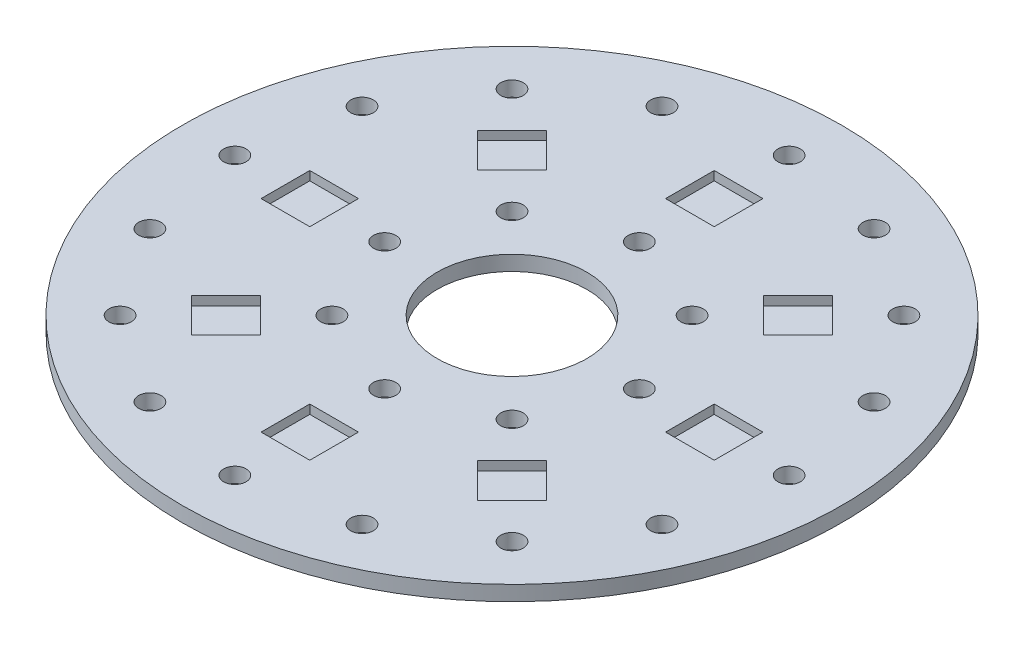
ISO-10303-21;
HEADER;
FILE_DESCRIPTION(('STEP AP214'),'2;1');
FILE_NAME('part.step','',(''),(''),'','','');
FILE_SCHEMA(('AUTOMOTIVE_DESIGN { 1 0 10303 214 1 1 1 1 }'));
ENDSEC;
DATA;
#1=APPLICATION_CONTEXT('core data for automotive mechanical design processes');
#2=APPLICATION_PROTOCOL_DEFINITION('international standard','automotive_design',2000,#1);
#3=PRODUCT_CONTEXT('',#1,'mechanical');
#4=PRODUCT('Part','Part','',(#3));
#5=PRODUCT_RELATED_PRODUCT_CATEGORY('part','',(#4));
#6=PRODUCT_DEFINITION_FORMATION('','',#4);
#7=PRODUCT_DEFINITION_CONTEXT('part definition',#1,'design');
#8=PRODUCT_DEFINITION('design','',#6,#7);
#9=PRODUCT_DEFINITION_SHAPE('','',#8);
#10=(LENGTH_UNIT() NAMED_UNIT(*) SI_UNIT(.MILLI.,.METRE.));
#11=(NAMED_UNIT(*) PLANE_ANGLE_UNIT() SI_UNIT($,.RADIAN.));
#12=(NAMED_UNIT(*) SI_UNIT($,.STERADIAN.) SOLID_ANGLE_UNIT());
#13=UNCERTAINTY_MEASURE_WITH_UNIT(LENGTH_MEASURE(1.E-05),#10,'distance_accuracy_value','');
#14=(GEOMETRIC_REPRESENTATION_CONTEXT(3) GLOBAL_UNCERTAINTY_ASSIGNED_CONTEXT((#13)) GLOBAL_UNIT_ASSIGNED_CONTEXT((#10,
#11,#12)) REPRESENTATION_CONTEXT('',''));
#15=CARTESIAN_POINT('',(0.,0.,0.));
#16=DIRECTION('',(0.,0.,1.));
#17=DIRECTION('',(1.,0.,0.));
#18=AXIS2_PLACEMENT_3D('',#15,#16,#17);
#19=CARTESIAN_POINT('',(-10.,2.,0.));
#20=DIRECTION('',(0.,-1.,0.));
#21=DIRECTION('',(0.,0.,-1.));
#22=AXIS2_PLACEMENT_3D('',#19,#20,#21);
#23=PLANE('',#22);
#24=DIRECTION('',(1.,0.,0.));
#25=VECTOR('',#24,1.);
#26=CARTESIAN_POINT('',(-30.25,2.,3.25));
#27=LINE('',#26,#25);
#28=CARTESIAN_POINT('',(-30.25,2.,3.25));
#29=VERTEX_POINT('',#28);
#30=CARTESIAN_POINT('',(-23.75,2.,3.25));
#31=VERTEX_POINT('',#30);
#32=EDGE_CURVE('E405',#29,#31,#27,.T.);
#33=ORIENTED_EDGE('',*,*,#32,.F.);
#34=DIRECTION('',(0.,0.,1.));
#35=VECTOR('',#34,1.);
#36=CARTESIAN_POINT('',(-30.25,2.,-3.25));
#37=LINE('',#36,#35);
#38=CARTESIAN_POINT('',(-30.25,2.,-3.25));
#39=VERTEX_POINT('',#38);
#40=EDGE_CURVE('E56',#39,#29,#37,.T.);
#41=ORIENTED_EDGE('',*,*,#40,.F.);
#42=DIRECTION('',(1.,0.,0.));
#43=VECTOR('',#42,1.);
#44=CARTESIAN_POINT('',(-30.25,2.,-3.25));
#45=LINE('',#44,#43);
#46=CARTESIAN_POINT('',(-23.75,2.,-3.25));
#47=VERTEX_POINT('',#46);
#48=EDGE_CURVE('E396',#39,#47,#45,.T.);
#49=ORIENTED_EDGE('',*,*,#48,.T.);
#50=DIRECTION('',(0.,0.,1.));
#51=VECTOR('',#50,1.);
#52=CARTESIAN_POINT('',(-23.75,2.,-3.25));
#53=LINE('',#52,#51);
#54=EDGE_CURVE('E400',#47,#31,#53,.T.);
#55=ORIENTED_EDGE('',*,*,#54,.T.);
#56=EDGE_LOOP('',(#33,#41,#49,#55));
#57=FACE_BOUND('',#56,.T.);
#58=DIRECTION('',(0.707106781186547,0.,-0.707106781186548));
#59=VECTOR('',#58,1.);
#60=CARTESIAN_POINT('',(-19.0918830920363,2.,23.6880771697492));
#61=LINE('',#60,#59);
#62=CARTESIAN_POINT('',(-19.0918830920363,2.,23.6880771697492));
#63=VERTEX_POINT('',#62);
#64=CARTESIAN_POINT('',(-14.4956890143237,2.,19.0918830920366));
#65=VERTEX_POINT('',#64);
#66=EDGE_CURVE('E447',#63,#65,#61,.T.);
#67=ORIENTED_EDGE('',*,*,#66,.F.);
#68=DIRECTION('',(0.707106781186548,0.,0.707106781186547));
#69=VECTOR('',#68,1.);
#70=CARTESIAN_POINT('',(-23.6880771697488,2.,19.0918830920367));
#71=LINE('',#70,#69);
#72=CARTESIAN_POINT('',(-23.6880771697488,2.,19.0918830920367));
#73=VERTEX_POINT('',#72);
#74=EDGE_CURVE('E64',#73,#63,#71,.T.);
#75=ORIENTED_EDGE('',*,*,#74,.F.);
#76=DIRECTION('',(0.707106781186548,0.,-0.707106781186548));
#77=VECTOR('',#76,1.);
#78=CARTESIAN_POINT('',(-23.6880771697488,2.,19.0918830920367));
#79=LINE('',#78,#77);
#80=CARTESIAN_POINT('',(-19.0918830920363,2.,14.4956890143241));
#81=VERTEX_POINT('',#80);
#82=EDGE_CURVE('E438',#73,#81,#79,.T.);
#83=ORIENTED_EDGE('',*,*,#82,.T.);
#84=DIRECTION('',(0.707106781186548,0.,0.707106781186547));
#85=VECTOR('',#84,1.);
#86=CARTESIAN_POINT('',(-19.0918830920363,2.,14.4956890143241));
#87=LINE('',#86,#85);
#88=EDGE_CURVE('E442',#81,#65,#87,.T.);
#89=ORIENTED_EDGE('',*,*,#88,.T.);
#90=EDGE_LOOP('',(#67,#75,#83,#89));
#91=FACE_BOUND('',#90,.T.);
#92=DIRECTION('',(0.,0.,-1.));
#93=VECTOR('',#92,1.);
#94=CARTESIAN_POINT('',(3.25000000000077,2.,30.2499999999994));
#95=LINE('',#94,#93);
#96=CARTESIAN_POINT('',(3.25000000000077,2.,30.2499999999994));
#97=VERTEX_POINT('',#96);
#98=CARTESIAN_POINT('',(3.25000000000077,2.,23.7499999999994));
#99=VERTEX_POINT('',#98);
#100=EDGE_CURVE('E489',#97,#99,#95,.T.);
#101=ORIENTED_EDGE('',*,*,#100,.F.);
#102=DIRECTION('',(1.,0.,0.));
#103=VECTOR('',#102,1.);
#104=CARTESIAN_POINT('',(-3.24999999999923,2.,30.2499999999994));
#105=LINE('',#104,#103);
#106=CARTESIAN_POINT('',(-3.24999999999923,2.,30.2499999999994));
#107=VERTEX_POINT('',#106);
#108=EDGE_CURVE('E437',#107,#97,#105,.T.);
#109=ORIENTED_EDGE('',*,*,#108,.F.);
#110=DIRECTION('',(0.,0.,-1.));
#111=VECTOR('',#110,1.);
#112=CARTESIAN_POINT('',(-3.24999999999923,2.,30.2499999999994));
#113=LINE('',#112,#111);
#114=CARTESIAN_POINT('',(-3.24999999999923,2.,23.7499999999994));
#115=VERTEX_POINT('',#114);
#116=EDGE_CURVE('E480',#107,#115,#113,.T.);
#117=ORIENTED_EDGE('',*,*,#116,.T.);
#118=DIRECTION('',(1.,0.,0.));
#119=VECTOR('',#118,1.);
#120=CARTESIAN_POINT('',(-3.24999999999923,2.,23.7499999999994));
#121=LINE('',#120,#119);
#122=EDGE_CURVE('E484',#115,#99,#121,.T.);
#123=ORIENTED_EDGE('',*,*,#122,.T.);
#124=EDGE_LOOP('',(#101,#109,#117,#123));
#125=FACE_BOUND('',#124,.T.);
#126=DIRECTION('',(-0.707106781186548,0.,-0.707106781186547));
#127=VECTOR('',#126,1.);
#128=CARTESIAN_POINT('',(23.68807716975,2.,19.0918830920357));
#129=LINE('',#128,#127);
#130=CARTESIAN_POINT('',(23.68807716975,2.,19.0918830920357));
#131=VERTEX_POINT('',#130);
#132=CARTESIAN_POINT('',(19.0918830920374,2.,14.4956890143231));
#133=VERTEX_POINT('',#132);
#134=EDGE_CURVE('E526',#131,#133,#129,.T.);
#135=ORIENTED_EDGE('',*,*,#134,.F.);
#136=DIRECTION('',(0.707106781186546,0.,-0.707106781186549));
#137=VECTOR('',#136,1.);
#138=CARTESIAN_POINT('',(19.0918830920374,2.,23.6880771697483));
#139=LINE('',#138,#137);
#140=CARTESIAN_POINT('',(19.0918830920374,2.,23.6880771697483));
#141=VERTEX_POINT('',#140);
#142=EDGE_CURVE('E479',#141,#131,#139,.T.);
#143=ORIENTED_EDGE('',*,*,#142,.F.);
#144=DIRECTION('',(-0.707106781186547,0.,-0.707106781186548));
#145=VECTOR('',#144,1.);
#146=CARTESIAN_POINT('',(19.0918830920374,2.,23.6880771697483));
#147=LINE('',#146,#145);
#148=CARTESIAN_POINT('',(14.4956890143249,2.,19.0918830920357));
#149=VERTEX_POINT('',#148);
#150=EDGE_CURVE('E517',#141,#149,#147,.T.);
#151=ORIENTED_EDGE('',*,*,#150,.T.);
#152=DIRECTION('',(0.707106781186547,0.,-0.707106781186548));
#153=VECTOR('',#152,1.);
#154=CARTESIAN_POINT('',(14.4956890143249,2.,19.0918830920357));
#155=LINE('',#154,#153);
#156=EDGE_CURVE('E521',#149,#133,#155,.T.);
#157=ORIENTED_EDGE('',*,*,#156,.T.);
#158=EDGE_LOOP('',(#135,#143,#151,#157));
#159=FACE_BOUND('',#158,.T.);
#160=DIRECTION('',(-1.,0.,0.));
#161=VECTOR('',#160,1.);
#162=CARTESIAN_POINT('',(30.2500000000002,2.,-3.25000000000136));
#163=LINE('',#162,#161);
#164=CARTESIAN_POINT('',(30.2500000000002,2.,-3.25000000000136));
#165=VERTEX_POINT('',#164);
#166=CARTESIAN_POINT('',(23.7500000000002,2.,-3.25000000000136));
#167=VERTEX_POINT('',#166);
#168=EDGE_CURVE('E276',#165,#167,#163,.T.);
#169=ORIENTED_EDGE('',*,*,#168,.F.);
#170=DIRECTION('',(0.,0.,-1.));
#171=VECTOR('',#170,1.);
#172=CARTESIAN_POINT('',(30.2500000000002,2.,3.24999999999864));
#173=LINE('',#172,#171);
#174=CARTESIAN_POINT('',(30.2500000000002,2.,3.24999999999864));
#175=VERTEX_POINT('',#174);
#176=EDGE_CURVE('E253',#175,#165,#173,.T.);
#177=ORIENTED_EDGE('',*,*,#176,.F.);
#178=DIRECTION('',(-1.,0.,0.));
#179=VECTOR('',#178,1.);
#180=CARTESIAN_POINT('',(30.2500000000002,2.,3.24999999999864));
#181=LINE('',#180,#179);
#182=CARTESIAN_POINT('',(23.7500000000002,2.,3.24999999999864));
#183=VERTEX_POINT('',#182);
#184=EDGE_CURVE('E264',#175,#183,#181,.T.);
#185=ORIENTED_EDGE('',*,*,#184,.T.);
#186=DIRECTION('',(0.,0.,-1.));
#187=VECTOR('',#186,1.);
#188=CARTESIAN_POINT('',(23.7500000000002,2.,3.24999999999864));
#189=LINE('',#188,#187);
#190=EDGE_CURVE('E271',#183,#167,#189,.T.);
#191=ORIENTED_EDGE('',*,*,#190,.T.);
#192=EDGE_LOOP('',(#169,#177,#185,#191));
#193=FACE_BOUND('',#192,.T.);
#194=DIRECTION('',(-0.707106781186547,0.,0.707106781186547));
#195=VECTOR('',#194,1.);
#196=CARTESIAN_POINT('',(19.0918830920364,2.,-23.6880771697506));
#197=LINE('',#196,#195);
#198=CARTESIAN_POINT('',(19.0918830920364,2.,-23.6880771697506));
#199=VERTEX_POINT('',#198);
#200=CARTESIAN_POINT('',(14.4956890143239,2.,-19.091883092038));
#201=VERTEX_POINT('',#200);
#202=EDGE_CURVE('E324',#199,#201,#197,.T.);
#203=ORIENTED_EDGE('',*,*,#202,.F.);
#204=DIRECTION('',(-0.707106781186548,0.,-0.707106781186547));
#205=VECTOR('',#204,1.);
#206=CARTESIAN_POINT('',(23.688077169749,2.,-19.091883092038));
#207=LINE('',#206,#205);
#208=CARTESIAN_POINT('',(23.688077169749,2.,-19.091883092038));
#209=VERTEX_POINT('',#208);
#210=EDGE_CURVE('E261',#209,#199,#207,.T.);
#211=ORIENTED_EDGE('',*,*,#210,.F.);
#212=DIRECTION('',(-0.707106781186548,0.,0.707106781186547));
#213=VECTOR('',#212,1.);
#214=CARTESIAN_POINT('',(23.688077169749,2.,-19.091883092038));
#215=LINE('',#214,#213);
#216=CARTESIAN_POINT('',(19.0918830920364,2.,-14.4956890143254));
#217=VERTEX_POINT('',#216);
#218=EDGE_CURVE('E315',#209,#217,#215,.T.);
#219=ORIENTED_EDGE('',*,*,#218,.T.);
#220=DIRECTION('',(-0.707106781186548,0.,-0.707106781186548));
#221=VECTOR('',#220,1.);
#222=CARTESIAN_POINT('',(19.0918830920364,2.,-14.4956890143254));
#223=LINE('',#222,#221);
#224=EDGE_CURVE('E319',#217,#201,#223,.T.);
#225=ORIENTED_EDGE('',*,*,#224,.T.);
#226=EDGE_LOOP('',(#203,#211,#219,#225));
#227=FACE_BOUND('',#226,.T.);
#228=DIRECTION('',(0.,0.,1.));
#229=VECTOR('',#228,1.);
#230=CARTESIAN_POINT('',(-3.2500000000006,2.,-30.2500000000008));
#231=LINE('',#230,#229);
#232=CARTESIAN_POINT('',(-3.2500000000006,2.,-30.2500000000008));
#233=VERTEX_POINT('',#232);
#234=CARTESIAN_POINT('',(-3.2500000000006,2.,-23.7500000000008));
#235=VERTEX_POINT('',#234);
#236=EDGE_CURVE('E365',#233,#235,#231,.T.);
#237=ORIENTED_EDGE('',*,*,#236,.F.);
#238=DIRECTION('',(-1.,0.,0.));
#239=VECTOR('',#238,1.);
#240=CARTESIAN_POINT('',(3.2499999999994,2.,-30.2500000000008));
#241=LINE('',#240,#239);
#242=CARTESIAN_POINT('',(3.2499999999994,2.,-30.2500000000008));
#243=VERTEX_POINT('',#242);
#244=EDGE_CURVE('E314',#243,#233,#241,.T.);
#245=ORIENTED_EDGE('',*,*,#244,.F.);
#246=DIRECTION('',(0.,0.,1.));
#247=VECTOR('',#246,1.);
#248=CARTESIAN_POINT('',(3.2499999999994,2.,-30.2500000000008));
#249=LINE('',#248,#247);
#250=CARTESIAN_POINT('',(3.2499999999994,2.,-23.7500000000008));
#251=VERTEX_POINT('',#250);
#252=EDGE_CURVE('E356',#243,#251,#249,.T.);
#253=ORIENTED_EDGE('',*,*,#252,.T.);
#254=DIRECTION('',(-1.,0.,0.));
#255=VECTOR('',#254,1.);
#256=CARTESIAN_POINT('',(3.2499999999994,2.,-23.7500000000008));
#257=LINE('',#256,#255);
#258=EDGE_CURVE('E360',#251,#235,#257,.T.);
#259=ORIENTED_EDGE('',*,*,#258,.T.);
#260=EDGE_LOOP('',(#237,#245,#253,#259));
#261=FACE_BOUND('',#260,.T.);
#262=DIRECTION('',(0.707106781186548,0.,0.707106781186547));
#263=VECTOR('',#262,1.);
#264=CARTESIAN_POINT('',(-23.6880771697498,2.,-19.091883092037));
#265=LINE('',#264,#263);
#266=CARTESIAN_POINT('',(-23.6880771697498,2.,-19.091883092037));
#267=VERTEX_POINT('',#266);
#268=CARTESIAN_POINT('',(-19.0918830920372,2.,-14.4956890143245));
#269=VERTEX_POINT('',#268);
#270=EDGE_CURVE('E562',#267,#269,#265,.T.);
#271=ORIENTED_EDGE('',*,*,#270,.F.);
#272=DIRECTION('',(-0.707106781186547,0.,0.707106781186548));
#273=VECTOR('',#272,1.);
#274=CARTESIAN_POINT('',(-19.0918830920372,2.,-23.6880771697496));
#275=LINE('',#274,#273);
#276=CARTESIAN_POINT('',(-19.0918830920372,2.,-23.6880771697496));
#277=VERTEX_POINT('',#276);
#278=EDGE_CURVE('E411',#277,#267,#275,.T.);
#279=ORIENTED_EDGE('',*,*,#278,.F.);
#280=DIRECTION('',(0.707106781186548,0.,0.707106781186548));
#281=VECTOR('',#280,1.);
#282=CARTESIAN_POINT('',(-19.0918830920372,2.,-23.6880771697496));
#283=LINE('',#282,#281);
#284=CARTESIAN_POINT('',(-14.4956890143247,2.,-19.091883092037));
#285=VERTEX_POINT('',#284);
#286=EDGE_CURVE('E549',#277,#285,#283,.T.);
#287=ORIENTED_EDGE('',*,*,#286,.T.);
#288=DIRECTION('',(-0.707106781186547,0.,0.707106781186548));
#289=VECTOR('',#288,1.);
#290=CARTESIAN_POINT('',(-14.4956890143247,2.,-19.091883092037));
#291=LINE('',#290,#289);
#292=EDGE_CURVE('E566',#285,#269,#291,.T.);
#293=ORIENTED_EDGE('',*,*,#292,.T.);
#294=EDGE_LOOP('',(#271,#279,#287,#293));
#295=FACE_BOUND('',#294,.T.);
#296=CARTESIAN_POINT('',(26.1629509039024,2.,-26.1629509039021));
#297=DIRECTION('',(0.,1.,0.));
#298=DIRECTION('',(0.,0.,1.));
#299=AXIS2_PLACEMENT_3D('',#296,#297,#298);
#300=CIRCLE('',#299,1.49999999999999);
#301=CARTESIAN_POINT('',(26.1629509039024,2.,-24.6629509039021));
#302=VERTEX_POINT('',#301);
#303=EDGE_CURVE('E630',#302,#302,#300,.T.);
#304=ORIENTED_EDGE('',*,*,#303,.F.);
#305=EDGE_LOOP('',(#304));
#306=FACE_BOUND('',#305,.T.);
#307=CARTESIAN_POINT('',(14.1592869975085,2.,-34.1835427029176));
#308=DIRECTION('',(0.,1.,0.));
#309=DIRECTION('',(0.,0.,1.));
#310=AXIS2_PLACEMENT_3D('',#307,#308,#309);
#311=CIRCLE('',#310,1.49999999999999);
#312=CARTESIAN_POINT('',(14.1592869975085,2.,-32.6835427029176));
#313=VERTEX_POINT('',#312);
#314=EDGE_CURVE('E635',#313,#313,#311,.T.);
#315=ORIENTED_EDGE('',*,*,#314,.F.);
#316=EDGE_LOOP('',(#315));
#317=FACE_BOUND('',#316,.T.);
#318=CARTESIAN_POINT('',(1.25510869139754E-13,2.,-37.));
#319=DIRECTION('',(0.,1.,0.));
#320=DIRECTION('',(0.,0.,1.));
#321=AXIS2_PLACEMENT_3D('',#318,#319,#320);
#322=CIRCLE('',#321,1.5);
#323=CARTESIAN_POINT('',(1.25510869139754E-13,2.,-35.5));
#324=VERTEX_POINT('',#323);
#325=EDGE_CURVE('E639',#324,#324,#322,.T.);
#326=ORIENTED_EDGE('',*,*,#325,.F.);
#327=EDGE_LOOP('',(#326));
#328=FACE_BOUND('',#327,.T.);
#329=CARTESIAN_POINT('',(-14.1592869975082,2.,-34.1835427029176));
#330=DIRECTION('',(0.,1.,0.));
#331=DIRECTION('',(0.,0.,1.));
#332=AXIS2_PLACEMENT_3D('',#329,#330,#331);
#333=CIRCLE('',#332,1.49999999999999);
#334=CARTESIAN_POINT('',(-14.1592869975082,2.,-32.6835427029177));
#335=VERTEX_POINT('',#334);
#336=EDGE_CURVE('E626',#335,#335,#333,.T.);
#337=ORIENTED_EDGE('',*,*,#336,.F.);
#338=EDGE_LOOP('',(#337));
#339=FACE_BOUND('',#338,.T.);
#340=CARTESIAN_POINT('',(-12.0208152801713,2.,-12.0208152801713));
#341=DIRECTION('',(0.,1.,0.));
#342=DIRECTION('',(0.,0.,1.));
#343=AXIS2_PLACEMENT_3D('',#340,#341,#342);
#344=CIRCLE('',#343,1.5);
#345=CARTESIAN_POINT('',(-12.0208152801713,2.,-10.5208152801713));
#346=VERTEX_POINT('',#345);
#347=EDGE_CURVE('E602',#346,#346,#344,.T.);
#348=ORIENTED_EDGE('',*,*,#347,.F.);
#349=EDGE_LOOP('',(#348));
#350=FACE_BOUND('',#349,.T.);
#351=CARTESIAN_POINT('',(-37.,2.,0.));
#352=DIRECTION('',(0.,1.,0.));
#353=DIRECTION('',(0.,0.,1.));
#354=AXIS2_PLACEMENT_3D('',#351,#352,#353);
#355=CIRCLE('',#354,1.5);
#356=CARTESIAN_POINT('',(-37.,2.,1.5));
#357=VERTEX_POINT('',#356);
#358=EDGE_CURVE('E614',#357,#357,#355,.T.);
#359=ORIENTED_EDGE('',*,*,#358,.F.);
#360=EDGE_LOOP('',(#359));
#361=FACE_BOUND('',#360,.T.);
#362=CARTESIAN_POINT('',(-34.1835427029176,2.,-14.1592869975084));
#363=DIRECTION('',(0.,1.,0.));
#364=DIRECTION('',(0.,0.,1.));
#365=AXIS2_PLACEMENT_3D('',#362,#363,#364);
#366=CIRCLE('',#365,1.49999999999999);
#367=CARTESIAN_POINT('',(-34.1835427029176,2.,-12.6592869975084));
#368=VERTEX_POINT('',#367);
#369=EDGE_CURVE('E618',#368,#368,#366,.T.);
#370=ORIENTED_EDGE('',*,*,#369,.F.);
#371=EDGE_LOOP('',(#370));
#372=FACE_BOUND('',#371,.T.);
#373=CARTESIAN_POINT('',(-26.1629509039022,2.,-26.1629509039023));
#374=DIRECTION('',(0.,1.,0.));
#375=DIRECTION('',(0.,0.,1.));
#376=AXIS2_PLACEMENT_3D('',#373,#374,#375);
#377=CIRCLE('',#376,1.49999999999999);
#378=CARTESIAN_POINT('',(-26.1629509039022,2.,-24.6629509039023));
#379=VERTEX_POINT('',#378);
#380=EDGE_CURVE('E622',#379,#379,#377,.T.);
#381=ORIENTED_EDGE('',*,*,#380,.F.);
#382=EDGE_LOOP('',(#381));
#383=FACE_BOUND('',#382,.T.);
#384=CARTESIAN_POINT('',(34.1835427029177,2.,-14.1592869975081));
#385=DIRECTION('',(0.,1.,0.));
#386=DIRECTION('',(0.,0.,1.));
#387=AXIS2_PLACEMENT_3D('',#384,#385,#386);
#388=CIRCLE('',#387,1.5);
#389=CARTESIAN_POINT('',(34.1835427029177,2.,-12.6592869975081));
#390=VERTEX_POINT('',#389);
#391=EDGE_CURVE('E634',#390,#390,#388,.T.);
#392=ORIENTED_EDGE('',*,*,#391,.F.);
#393=EDGE_LOOP('',(#392));
#394=FACE_BOUND('',#393,.T.);
#395=CARTESIAN_POINT('',(37.,2.,2.5469567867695E-13));
#396=DIRECTION('',(0.,1.,0.));
#397=DIRECTION('',(0.,0.,1.));
#398=AXIS2_PLACEMENT_3D('',#395,#396,#397);
#399=CIRCLE('',#398,1.49999999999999);
#400=CARTESIAN_POINT('',(37.,2.,1.50000000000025));
#401=VERTEX_POINT('',#400);
#402=EDGE_CURVE('E671',#401,#401,#399,.T.);
#403=ORIENTED_EDGE('',*,*,#402,.F.);
#404=EDGE_LOOP('',(#403));
#405=FACE_BOUND('',#404,.T.);
#406=CARTESIAN_POINT('',(34.1835427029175,2.,14.1592869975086));
#407=DIRECTION('',(0.,1.,0.));
#408=DIRECTION('',(0.,0.,1.));
#409=AXIS2_PLACEMENT_3D('',#406,#407,#408);
#410=CIRCLE('',#409,1.5);
#411=CARTESIAN_POINT('',(34.1835427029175,2.,15.6592869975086));
#412=VERTEX_POINT('',#411);
#413=EDGE_CURVE('E667',#412,#412,#410,.T.);
#414=ORIENTED_EDGE('',*,*,#413,.F.);
#415=EDGE_LOOP('',(#414));
#416=FACE_BOUND('',#415,.T.);
#417=CARTESIAN_POINT('',(26.162950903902,2.,26.1629509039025));
#418=DIRECTION('',(0.,1.,0.));
#419=DIRECTION('',(0.,0.,1.));
#420=AXIS2_PLACEMENT_3D('',#417,#418,#419);
#421=CIRCLE('',#420,1.5);
#422=CARTESIAN_POINT('',(26.162950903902,2.,27.6629509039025));
#423=VERTEX_POINT('',#422);
#424=EDGE_CURVE('E663',#423,#423,#421,.T.);
#425=ORIENTED_EDGE('',*,*,#424,.F.);
#426=EDGE_LOOP('',(#425));
#427=FACE_BOUND('',#426,.T.);
#428=CARTESIAN_POINT('',(14.159286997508,2.,34.1835427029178));
#429=DIRECTION('',(0.,1.,0.));
#430=DIRECTION('',(0.,0.,1.));
#431=AXIS2_PLACEMENT_3D('',#428,#429,#430);
#432=CIRCLE('',#431,1.5);
#433=CARTESIAN_POINT('',(14.159286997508,2.,35.6835427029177));
#434=VERTEX_POINT('',#433);
#435=EDGE_CURVE('E659',#434,#434,#432,.T.);
#436=ORIENTED_EDGE('',*,*,#435,.F.);
#437=EDGE_LOOP('',(#436));
#438=FACE_BOUND('',#437,.T.);
#439=CARTESIAN_POINT('',(-3.83880488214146E-13,2.,37.));
#440=DIRECTION('',(0.,1.,0.));
#441=DIRECTION('',(0.,0.,1.));
#442=AXIS2_PLACEMENT_3D('',#439,#440,#441);
#443=CIRCLE('',#442,1.5);
#444=CARTESIAN_POINT('',(-3.83880488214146E-13,2.,38.5));
#445=VERTEX_POINT('',#444);
#446=EDGE_CURVE('E655',#445,#445,#443,.T.);
#447=ORIENTED_EDGE('',*,*,#446,.F.);
#448=EDGE_LOOP('',(#447));
#449=FACE_BOUND('',#448,.T.);
#450=CARTESIAN_POINT('',(-14.1592869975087,2.,34.1835427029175));
#451=DIRECTION('',(0.,1.,0.));
#452=DIRECTION('',(0.,0.,1.));
#453=AXIS2_PLACEMENT_3D('',#450,#451,#452);
#454=CIRCLE('',#453,1.5);
#455=CARTESIAN_POINT('',(-14.1592869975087,2.,35.6835427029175));
#456=VERTEX_POINT('',#455);
#457=EDGE_CURVE('E651',#456,#456,#454,.T.);
#458=ORIENTED_EDGE('',*,*,#457,.F.);
#459=EDGE_LOOP('',(#458));
#460=FACE_BOUND('',#459,.T.);
#461=CARTESIAN_POINT('',(-26.1629509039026,2.,26.1629509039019));
#462=DIRECTION('',(0.,1.,0.));
#463=DIRECTION('',(0.,0.,1.));
#464=AXIS2_PLACEMENT_3D('',#461,#462,#463);
#465=CIRCLE('',#464,1.5);
#466=CARTESIAN_POINT('',(-26.1629509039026,2.,27.6629509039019));
#467=VERTEX_POINT('',#466);
#468=EDGE_CURVE('E646',#467,#467,#465,.T.);
#469=ORIENTED_EDGE('',*,*,#468,.F.);
#470=EDGE_LOOP('',(#469));
#471=FACE_BOUND('',#470,.T.);
#472=CARTESIAN_POINT('',(-5.96908354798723E-13,2.,-17.0000000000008));
#473=DIRECTION('',(0.,1.,0.));
#474=DIRECTION('',(0.,0.,1.));
#475=AXIS2_PLACEMENT_3D('',#472,#473,#474);
#476=CIRCLE('',#475,1.50000000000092);
#477=CARTESIAN_POINT('',(-5.96908354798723E-13,2.,-15.4999999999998));
#478=VERTEX_POINT('',#477);
#479=EDGE_CURVE('E576',#478,#478,#476,.T.);
#480=ORIENTED_EDGE('',*,*,#479,.F.);
#481=EDGE_LOOP('',(#480));
#482=FACE_BOUND('',#481,.T.);
#483=CARTESIAN_POINT('',(12.020815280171,2.,-12.0208152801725));
#484=DIRECTION('',(0.,1.,0.));
#485=DIRECTION('',(0.,0.,1.));
#486=AXIS2_PLACEMENT_3D('',#483,#484,#485);
#487=CIRCLE('',#486,1.50000000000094);
#488=CARTESIAN_POINT('',(12.020815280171,2.,-10.5208152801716));
#489=VERTEX_POINT('',#488);
#490=EDGE_CURVE('E591',#489,#489,#487,.T.);
#491=ORIENTED_EDGE('',*,*,#490,.F.);
#492=EDGE_LOOP('',(#491));
#493=FACE_BOUND('',#492,.T.);
#494=CARTESIAN_POINT('',(17.0000000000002,2.,-1.35949291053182E-12));
#495=DIRECTION('',(0.,1.,0.));
#496=DIRECTION('',(0.,0.,1.));
#497=AXIS2_PLACEMENT_3D('',#494,#495,#496);
#498=CIRCLE('',#497,1.50000000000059);
#499=CARTESIAN_POINT('',(17.0000000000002,2.,1.49999999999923));
#500=VERTEX_POINT('',#499);
#501=EDGE_CURVE('E586',#500,#500,#498,.T.);
#502=ORIENTED_EDGE('',*,*,#501,.F.);
#503=EDGE_LOOP('',(#502));
#504=FACE_BOUND('',#503,.T.);
#505=CARTESIAN_POINT('',(12.0208152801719,2.,12.0208152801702));
#506=DIRECTION('',(0.,1.,0.));
#507=DIRECTION('',(0.,0.,1.));
#508=AXIS2_PLACEMENT_3D('',#505,#506,#507);
#509=CIRCLE('',#508,1.50000000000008);
#510=CARTESIAN_POINT('',(12.0208152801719,2.,13.5208152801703));
#511=VERTEX_POINT('',#510);
#512=EDGE_CURVE('E590',#511,#511,#509,.T.);
#513=ORIENTED_EDGE('',*,*,#512,.F.);
#514=EDGE_LOOP('',(#513));
#515=FACE_BOUND('',#514,.T.);
#516=CARTESIAN_POINT('',(7.65523708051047E-13,2.,16.9999999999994));
#517=DIRECTION('',(0.,1.,0.));
#518=DIRECTION('',(0.,0.,1.));
#519=AXIS2_PLACEMENT_3D('',#516,#517,#518);
#520=CIRCLE('',#519,1.49999999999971);
#521=CARTESIAN_POINT('',(7.65523708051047E-13,2.,18.4999999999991));
#522=VERTEX_POINT('',#521);
#523=EDGE_CURVE('E607',#522,#522,#520,.T.);
#524=ORIENTED_EDGE('',*,*,#523,.F.);
#525=EDGE_LOOP('',(#524));
#526=FACE_BOUND('',#525,.T.);
#527=CARTESIAN_POINT('',(-12.0208152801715,2.,12.0208152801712));
#528=DIRECTION('',(0.,1.,0.));
#529=DIRECTION('',(0.,0.,1.));
#530=AXIS2_PLACEMENT_3D('',#527,#528,#529);
#531=CIRCLE('',#530,1.5);
#532=CARTESIAN_POINT('',(-12.0208152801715,2.,13.5208152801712));
#533=VERTEX_POINT('',#532);
#534=EDGE_CURVE('E603',#533,#533,#531,.T.);
#535=ORIENTED_EDGE('',*,*,#534,.F.);
#536=EDGE_LOOP('',(#535));
#537=FACE_BOUND('',#536,.T.);
#538=CARTESIAN_POINT('',(-17.,2.,0.));
#539=DIRECTION('',(0.,1.,0.));
#540=DIRECTION('',(0.,0.,1.));
#541=AXIS2_PLACEMENT_3D('',#538,#539,#540);
#542=CIRCLE('',#541,1.5);
#543=CARTESIAN_POINT('',(-17.,2.,1.5));
#544=VERTEX_POINT('',#543);
#545=EDGE_CURVE('E598',#544,#544,#542,.T.);
#546=ORIENTED_EDGE('',*,*,#545,.F.);
#547=EDGE_LOOP('',(#546));
#548=FACE_BOUND('',#547,.T.);
#549=CARTESIAN_POINT('',(-34.1835427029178,2.,14.1592869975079));
#550=DIRECTION('',(0.,1.,0.));
#551=DIRECTION('',(0.,0.,1.));
#552=AXIS2_PLACEMENT_3D('',#549,#550,#551);
#553=CIRCLE('',#552,1.5);
#554=CARTESIAN_POINT('',(-34.1835427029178,2.,15.6592869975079));
#555=VERTEX_POINT('',#554);
#556=EDGE_CURVE('E650',#555,#555,#553,.T.);
#557=ORIENTED_EDGE('',*,*,#556,.F.);
#558=EDGE_LOOP('',(#557));
#559=FACE_BOUND('',#558,.T.);
#560=CARTESIAN_POINT('',(0.,2.,0.));
#561=DIRECTION('',(0.,-1.,0.));
#562=DIRECTION('',(0.,0.,-1.));
#563=AXIS2_PLACEMENT_3D('',#560,#561,#562);
#564=CIRCLE('',#563,44.);
#565=CARTESIAN_POINT('',(0.,2.,-44.));
#566=VERTEX_POINT('',#565);
#567=EDGE_CURVE('E682',#566,#566,#564,.T.);
#568=ORIENTED_EDGE('',*,*,#567,.F.);
#569=EDGE_LOOP('',(#568));
#570=FACE_BOUND('',#569,.T.);
#571=CARTESIAN_POINT('',(0.,2.,0.));
#572=DIRECTION('',(0.,-1.,0.));
#573=DIRECTION('',(0.,0.,-1.));
#574=AXIS2_PLACEMENT_3D('',#571,#572,#573);
#575=CIRCLE('',#574,10.);
#576=CARTESIAN_POINT('',(0.,2.,-10.));
#577=VERTEX_POINT('',#576);
#578=EDGE_CURVE('E11',#577,#577,#575,.T.);
#579=ORIENTED_EDGE('',*,*,#578,.T.);
#580=EDGE_LOOP('',(#579));
#581=FACE_BOUND('',#580,.T.);
#582=ADVANCED_FACE('F39',(#57,#91,#125,#159,#193,#227,#261,#295,#306,#317,#328,#339,#350,#361,
#372,#383,#394,#405,#416,#427,#438,#449,#460,#471,#482,#493,#504,#515,#526,#537,#548,#559,#570,
#581),#23,.F.);
#583=CARTESIAN_POINT('',(0.,0.,0.));
#584=DIRECTION('',(0.,-1.,0.));
#585=DIRECTION('',(0.,0.,-1.));
#586=AXIS2_PLACEMENT_3D('',#583,#584,#585);
#587=CYLINDRICAL_SURFACE('',#586,10.);
#588=CARTESIAN_POINT('',(0.,0.,0.));
#589=DIRECTION('',(0.,-1.,0.));
#590=DIRECTION('',(0.,0.,-1.));
#591=AXIS2_PLACEMENT_3D('',#588,#589,#590);
#592=CIRCLE('',#591,10.);
#593=CARTESIAN_POINT('',(0.,0.,-10.));
#594=VERTEX_POINT('',#593);
#595=EDGE_CURVE('E48',#594,#594,#592,.T.);
#596=ORIENTED_EDGE('',*,*,#595,.T.);
#597=EDGE_LOOP('',(#596));
#598=FACE_BOUND('',#597,.T.);
#599=ORIENTED_EDGE('',*,*,#578,.F.);
#600=EDGE_LOOP('',(#599));
#601=FACE_BOUND('',#600,.T.);
#602=ADVANCED_FACE('F795',(#598,#601),#587,.F.);
#603=CARTESIAN_POINT('',(-10.,0.,0.));
#604=DIRECTION('',(0.,-1.,0.));
#605=DIRECTION('',(0.,0.,-1.));
#606=AXIS2_PLACEMENT_3D('',#603,#604,#605);
#607=PLANE('',#606);
#608=CARTESIAN_POINT('',(26.1629509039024,0.,-26.1629509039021));
#609=DIRECTION('',(0.,-1.,0.));
#610=DIRECTION('',(0.,0.,-1.));
#611=AXIS2_PLACEMENT_3D('',#608,#609,#610);
#612=CIRCLE('',#611,1.49999999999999);
#613=CARTESIAN_POINT('',(26.1629509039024,0.,-27.6629509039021));
#614=VERTEX_POINT('',#613);
#615=EDGE_CURVE('E42',#614,#614,#612,.T.);
#616=ORIENTED_EDGE('',*,*,#615,.F.);
#617=EDGE_LOOP('',(#616));
#618=FACE_BOUND('',#617,.T.);
#619=CARTESIAN_POINT('',(14.1592869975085,0.,-34.1835427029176));
#620=DIRECTION('',(0.,-1.,0.));
#621=DIRECTION('',(0.,0.,-1.));
#622=AXIS2_PLACEMENT_3D('',#619,#620,#621);
#623=CIRCLE('',#622,1.49999999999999);
#624=CARTESIAN_POINT('',(14.1592869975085,0.,-35.6835427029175));
#625=VERTEX_POINT('',#624);
#626=EDGE_CURVE('E779',#625,#625,#623,.T.);
#627=ORIENTED_EDGE('',*,*,#626,.F.);
#628=EDGE_LOOP('',(#627));
#629=FACE_BOUND('',#628,.T.);
#630=CARTESIAN_POINT('',(1.25510869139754E-13,0.,-37.));
#631=DIRECTION('',(0.,-1.,0.));
#632=DIRECTION('',(0.,0.,-1.));
#633=AXIS2_PLACEMENT_3D('',#630,#631,#632);
#634=CIRCLE('',#633,1.5);
#635=CARTESIAN_POINT('',(1.25510869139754E-13,0.,-38.5));
#636=VERTEX_POINT('',#635);
#637=EDGE_CURVE('E776',#636,#636,#634,.T.);
#638=ORIENTED_EDGE('',*,*,#637,.F.);
#639=EDGE_LOOP('',(#638));
#640=FACE_BOUND('',#639,.T.);
#641=CARTESIAN_POINT('',(-14.1592869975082,0.,-34.1835427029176));
#642=DIRECTION('',(0.,-1.,0.));
#643=DIRECTION('',(0.,0.,-1.));
#644=AXIS2_PLACEMENT_3D('',#641,#642,#643);
#645=CIRCLE('',#644,1.49999999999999);
#646=CARTESIAN_POINT('',(-14.1592869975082,0.,-35.6835427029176));
#647=VERTEX_POINT('',#646);
#648=EDGE_CURVE('E772',#647,#647,#645,.T.);
#649=ORIENTED_EDGE('',*,*,#648,.F.);
#650=EDGE_LOOP('',(#649));
#651=FACE_BOUND('',#650,.T.);
#652=CARTESIAN_POINT('',(-12.0208152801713,0.,-12.0208152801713));
#653=DIRECTION('',(0.,-1.,0.));
#654=DIRECTION('',(0.,0.,-1.));
#655=AXIS2_PLACEMENT_3D('',#652,#653,#654);
#656=CIRCLE('',#655,1.5);
#657=CARTESIAN_POINT('',(-12.0208152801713,0.,-13.5208152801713));
#658=VERTEX_POINT('',#657);
#659=EDGE_CURVE('E768',#658,#658,#656,.T.);
#660=ORIENTED_EDGE('',*,*,#659,.F.);
#661=EDGE_LOOP('',(#660));
#662=FACE_BOUND('',#661,.T.);
#663=CARTESIAN_POINT('',(-37.,0.,0.));
#664=DIRECTION('',(0.,-1.,0.));
#665=DIRECTION('',(0.,0.,-1.));
#666=AXIS2_PLACEMENT_3D('',#663,#664,#665);
#667=CIRCLE('',#666,1.5);
#668=CARTESIAN_POINT('',(-37.,0.,-1.49999999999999));
#669=VERTEX_POINT('',#668);
#670=EDGE_CURVE('E764',#669,#669,#667,.T.);
#671=ORIENTED_EDGE('',*,*,#670,.F.);
#672=EDGE_LOOP('',(#671));
#673=FACE_BOUND('',#672,.T.);
#674=CARTESIAN_POINT('',(-34.1835427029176,0.,-14.1592869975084));
#675=DIRECTION('',(0.,-1.,0.));
#676=DIRECTION('',(0.,0.,-1.));
#677=AXIS2_PLACEMENT_3D('',#674,#675,#676);
#678=CIRCLE('',#677,1.49999999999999);
#679=CARTESIAN_POINT('',(-34.1835427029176,0.,-15.6592869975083));
#680=VERTEX_POINT('',#679);
#681=EDGE_CURVE('E760',#680,#680,#678,.T.);
#682=ORIENTED_EDGE('',*,*,#681,.F.);
#683=EDGE_LOOP('',(#682));
#684=FACE_BOUND('',#683,.T.);
#685=CARTESIAN_POINT('',(-26.1629509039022,0.,-26.1629509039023));
#686=DIRECTION('',(0.,-1.,0.));
#687=DIRECTION('',(0.,0.,-1.));
#688=AXIS2_PLACEMENT_3D('',#685,#686,#687);
#689=CIRCLE('',#688,1.49999999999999);
#690=CARTESIAN_POINT('',(-26.1629509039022,0.,-27.6629509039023));
#691=VERTEX_POINT('',#690);
#692=EDGE_CURVE('E756',#691,#691,#689,.T.);
#693=ORIENTED_EDGE('',*,*,#692,.F.);
#694=EDGE_LOOP('',(#693));
#695=FACE_BOUND('',#694,.T.);
#696=CARTESIAN_POINT('',(34.1835427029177,0.,-14.1592869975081));
#697=DIRECTION('',(0.,-1.,0.));
#698=DIRECTION('',(0.,0.,-1.));
#699=AXIS2_PLACEMENT_3D('',#696,#697,#698);
#700=CIRCLE('',#699,1.5);
#701=CARTESIAN_POINT('',(34.1835427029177,0.,-15.6592869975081));
#702=VERTEX_POINT('',#701);
#703=EDGE_CURVE('E752',#702,#702,#700,.T.);
#704=ORIENTED_EDGE('',*,*,#703,.F.);
#705=EDGE_LOOP('',(#704));
#706=FACE_BOUND('',#705,.T.);
#707=CARTESIAN_POINT('',(37.,0.,2.5469567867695E-13));
#708=DIRECTION('',(0.,-1.,0.));
#709=DIRECTION('',(0.,0.,-1.));
#710=AXIS2_PLACEMENT_3D('',#707,#708,#709);
#711=CIRCLE('',#710,1.49999999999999);
#712=CARTESIAN_POINT('',(37.,0.,-1.49999999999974));
#713=VERTEX_POINT('',#712);
#714=EDGE_CURVE('E748',#713,#713,#711,.T.);
#715=ORIENTED_EDGE('',*,*,#714,.F.);
#716=EDGE_LOOP('',(#715));
#717=FACE_BOUND('',#716,.T.);
#718=CARTESIAN_POINT('',(34.1835427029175,0.,14.1592869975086));
#719=DIRECTION('',(0.,-1.,0.));
#720=DIRECTION('',(0.,0.,-1.));
#721=AXIS2_PLACEMENT_3D('',#718,#719,#720);
#722=CIRCLE('',#721,1.5);
#723=CARTESIAN_POINT('',(34.1835427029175,0.,12.6592869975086));
#724=VERTEX_POINT('',#723);
#725=EDGE_CURVE('E744',#724,#724,#722,.T.);
#726=ORIENTED_EDGE('',*,*,#725,.F.);
#727=EDGE_LOOP('',(#726));
#728=FACE_BOUND('',#727,.T.);
#729=CARTESIAN_POINT('',(26.162950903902,0.,26.1629509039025));
#730=DIRECTION('',(0.,-1.,0.));
#731=DIRECTION('',(0.,0.,-1.));
#732=AXIS2_PLACEMENT_3D('',#729,#730,#731);
#733=CIRCLE('',#732,1.5);
#734=CARTESIAN_POINT('',(26.162950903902,0.,24.6629509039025));
#735=VERTEX_POINT('',#734);
#736=EDGE_CURVE('E740',#735,#735,#733,.T.);
#737=ORIENTED_EDGE('',*,*,#736,.F.);
#738=EDGE_LOOP('',(#737));
#739=FACE_BOUND('',#738,.T.);
#740=CARTESIAN_POINT('',(14.159286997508,0.,34.1835427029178));
#741=DIRECTION('',(0.,-1.,0.));
#742=DIRECTION('',(0.,0.,-1.));
#743=AXIS2_PLACEMENT_3D('',#740,#741,#742);
#744=CIRCLE('',#743,1.5);
#745=CARTESIAN_POINT('',(14.159286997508,0.,32.6835427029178));
#746=VERTEX_POINT('',#745);
#747=EDGE_CURVE('E736',#746,#746,#744,.T.);
#748=ORIENTED_EDGE('',*,*,#747,.F.);
#749=EDGE_LOOP('',(#748));
#750=FACE_BOUND('',#749,.T.);
#751=CARTESIAN_POINT('',(-3.83880488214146E-13,0.,37.));
#752=DIRECTION('',(0.,-1.,0.));
#753=DIRECTION('',(0.,0.,-1.));
#754=AXIS2_PLACEMENT_3D('',#751,#752,#753);
#755=CIRCLE('',#754,1.5);
#756=CARTESIAN_POINT('',(-3.83880488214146E-13,0.,35.5));
#757=VERTEX_POINT('',#756);
#758=EDGE_CURVE('E732',#757,#757,#755,.T.);
#759=ORIENTED_EDGE('',*,*,#758,.F.);
#760=EDGE_LOOP('',(#759));
#761=FACE_BOUND('',#760,.T.);
#762=CARTESIAN_POINT('',(-14.1592869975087,0.,34.1835427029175));
#763=DIRECTION('',(0.,-1.,0.));
#764=DIRECTION('',(0.,0.,-1.));
#765=AXIS2_PLACEMENT_3D('',#762,#763,#764);
#766=CIRCLE('',#765,1.5);
#767=CARTESIAN_POINT('',(-14.1592869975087,0.,32.6835427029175));
#768=VERTEX_POINT('',#767);
#769=EDGE_CURVE('E728',#768,#768,#766,.T.);
#770=ORIENTED_EDGE('',*,*,#769,.F.);
#771=EDGE_LOOP('',(#770));
#772=FACE_BOUND('',#771,.T.);
#773=CARTESIAN_POINT('',(-26.1629509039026,0.,26.1629509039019));
#774=DIRECTION('',(0.,-1.,0.));
#775=DIRECTION('',(0.,0.,-1.));
#776=AXIS2_PLACEMENT_3D('',#773,#774,#775);
#777=CIRCLE('',#776,1.5);
#778=CARTESIAN_POINT('',(-26.1629509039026,0.,24.662950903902));
#779=VERTEX_POINT('',#778);
#780=EDGE_CURVE('E724',#779,#779,#777,.T.);
#781=ORIENTED_EDGE('',*,*,#780,.F.);
#782=EDGE_LOOP('',(#781));
#783=FACE_BOUND('',#782,.T.);
#784=CARTESIAN_POINT('',(-5.96908354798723E-13,0.,-17.0000000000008));
#785=DIRECTION('',(0.,-1.,0.));
#786=DIRECTION('',(0.,0.,-1.));
#787=AXIS2_PLACEMENT_3D('',#784,#785,#786);
#788=CIRCLE('',#787,1.50000000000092);
#789=CARTESIAN_POINT('',(-5.96908354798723E-13,0.,-18.5000000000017));
#790=VERTEX_POINT('',#789);
#791=EDGE_CURVE('E720',#790,#790,#788,.T.);
#792=ORIENTED_EDGE('',*,*,#791,.F.);
#793=EDGE_LOOP('',(#792));
#794=FACE_BOUND('',#793,.T.);
#795=CARTESIAN_POINT('',(12.020815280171,0.,-12.0208152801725));
#796=DIRECTION('',(0.,-1.,0.));
#797=DIRECTION('',(0.,0.,-1.));
#798=AXIS2_PLACEMENT_3D('',#795,#796,#797);
#799=CIRCLE('',#798,1.50000000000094);
#800=CARTESIAN_POINT('',(12.020815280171,0.,-13.5208152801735));
#801=VERTEX_POINT('',#800);
#802=EDGE_CURVE('E716',#801,#801,#799,.T.);
#803=ORIENTED_EDGE('',*,*,#802,.F.);
#804=EDGE_LOOP('',(#803));
#805=FACE_BOUND('',#804,.T.);
#806=CARTESIAN_POINT('',(17.0000000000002,0.,-1.35949291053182E-12));
#807=DIRECTION('',(0.,-1.,0.));
#808=DIRECTION('',(0.,0.,-1.));
#809=AXIS2_PLACEMENT_3D('',#806,#807,#808);
#810=CIRCLE('',#809,1.50000000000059);
#811=CARTESIAN_POINT('',(17.0000000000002,0.,-1.50000000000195));
#812=VERTEX_POINT('',#811);
#813=EDGE_CURVE('E712',#812,#812,#810,.T.);
#814=ORIENTED_EDGE('',*,*,#813,.F.);
#815=EDGE_LOOP('',(#814));
#816=FACE_BOUND('',#815,.T.);
#817=CARTESIAN_POINT('',(12.0208152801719,0.,12.0208152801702));
#818=DIRECTION('',(0.,-1.,0.));
#819=DIRECTION('',(0.,0.,-1.));
#820=AXIS2_PLACEMENT_3D('',#817,#818,#819);
#821=CIRCLE('',#820,1.50000000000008);
#822=CARTESIAN_POINT('',(12.0208152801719,0.,10.5208152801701));
#823=VERTEX_POINT('',#822);
#824=EDGE_CURVE('E708',#823,#823,#821,.T.);
#825=ORIENTED_EDGE('',*,*,#824,.F.);
#826=EDGE_LOOP('',(#825));
#827=FACE_BOUND('',#826,.T.);
#828=CARTESIAN_POINT('',(7.65523708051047E-13,0.,16.9999999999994));
#829=DIRECTION('',(0.,-1.,0.));
#830=DIRECTION('',(0.,0.,-1.));
#831=AXIS2_PLACEMENT_3D('',#828,#829,#830);
#832=CIRCLE('',#831,1.49999999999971);
#833=CARTESIAN_POINT('',(7.65523708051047E-13,0.,15.4999999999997));
#834=VERTEX_POINT('',#833);
#835=EDGE_CURVE('E704',#834,#834,#832,.T.);
#836=ORIENTED_EDGE('',*,*,#835,.F.);
#837=EDGE_LOOP('',(#836));
#838=FACE_BOUND('',#837,.T.);
#839=CARTESIAN_POINT('',(-12.0208152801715,0.,12.0208152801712));
#840=DIRECTION('',(0.,-1.,0.));
#841=DIRECTION('',(0.,0.,-1.));
#842=AXIS2_PLACEMENT_3D('',#839,#840,#841);
#843=CIRCLE('',#842,1.5);
#844=CARTESIAN_POINT('',(-12.0208152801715,0.,10.5208152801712));
#845=VERTEX_POINT('',#844);
#846=EDGE_CURVE('E700',#845,#845,#843,.T.);
#847=ORIENTED_EDGE('',*,*,#846,.F.);
#848=EDGE_LOOP('',(#847));
#849=FACE_BOUND('',#848,.T.);
#850=CARTESIAN_POINT('',(-17.,0.,0.));
#851=DIRECTION('',(0.,-1.,0.));
#852=DIRECTION('',(0.,0.,-1.));
#853=AXIS2_PLACEMENT_3D('',#850,#851,#852);
#854=CIRCLE('',#853,1.5);
#855=CARTESIAN_POINT('',(-17.,0.,-1.5));
#856=VERTEX_POINT('',#855);
#857=EDGE_CURVE('E696',#856,#856,#854,.T.);
#858=ORIENTED_EDGE('',*,*,#857,.F.);
#859=EDGE_LOOP('',(#858));
#860=FACE_BOUND('',#859,.T.);
#861=CARTESIAN_POINT('',(-34.1835427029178,0.,14.1592869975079));
#862=DIRECTION('',(0.,-1.,0.));
#863=DIRECTION('',(0.,0.,-1.));
#864=AXIS2_PLACEMENT_3D('',#861,#862,#863);
#865=CIRCLE('',#864,1.5);
#866=CARTESIAN_POINT('',(-34.1835427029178,0.,12.6592869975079));
#867=VERTEX_POINT('',#866);
#868=EDGE_CURVE('E681',#867,#867,#865,.T.);
#869=ORIENTED_EDGE('',*,*,#868,.F.);
#870=EDGE_LOOP('',(#869));
#871=FACE_BOUND('',#870,.T.);
#872=CARTESIAN_POINT('',(0.,0.,0.));
#873=DIRECTION('',(0.,-1.,0.));
#874=DIRECTION('',(0.,0.,-1.));
#875=AXIS2_PLACEMENT_3D('',#872,#873,#874);
#876=CIRCLE('',#875,44.);
#877=CARTESIAN_POINT('',(0.,0.,-44.));
#878=VERTEX_POINT('',#877);
#879=EDGE_CURVE('E686',#878,#878,#876,.T.);
#880=ORIENTED_EDGE('',*,*,#879,.T.);
#881=EDGE_LOOP('',(#880));
#882=FACE_BOUND('',#881,.T.);
#883=ORIENTED_EDGE('',*,*,#595,.F.);
#884=EDGE_LOOP('',(#883));
#885=FACE_BOUND('',#884,.T.);
#886=ADVANCED_FACE('F791',(#618,#629,#640,#651,#662,#673,#684,#695,#706,#717,#728,#739,#750,
#761,#772,#783,#794,#805,#816,#827,#838,#849,#860,#871,#882,#885),#607,.T.);
#887=CARTESIAN_POINT('',(0.,0.,0.));
#888=DIRECTION('',(0.,-1.,0.));
#889=DIRECTION('',(0.,0.,-1.));
#890=AXIS2_PLACEMENT_3D('',#887,#888,#889);
#891=CYLINDRICAL_SURFACE('',#890,44.);
#892=ORIENTED_EDGE('',*,*,#567,.T.);
#893=EDGE_LOOP('',(#892));
#894=FACE_BOUND('',#893,.T.);
#895=ORIENTED_EDGE('',*,*,#879,.F.);
#896=EDGE_LOOP('',(#895));
#897=FACE_BOUND('',#896,.T.);
#898=ADVANCED_FACE('F794',(#894,#897),#891,.T.);
#899=CARTESIAN_POINT('',(-34.1835427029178,-8.,14.1592869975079));
#900=DIRECTION('',(0.,1.,0.));
#901=DIRECTION('',(0.,0.,1.));
#902=AXIS2_PLACEMENT_3D('',#899,#900,#901);
#903=CYLINDRICAL_SURFACE('',#902,1.5);
#904=ORIENTED_EDGE('',*,*,#868,.T.);
#905=EDGE_LOOP('',(#904));
#906=FACE_BOUND('',#905,.T.);
#907=ORIENTED_EDGE('',*,*,#556,.T.);
#908=EDGE_LOOP('',(#907));
#909=FACE_BOUND('',#908,.T.);
#910=ADVANCED_FACE('F934',(#906,#909),#903,.F.);
#911=CARTESIAN_POINT('',(-17.,-8.,0.));
#912=DIRECTION('',(0.,1.,0.));
#913=DIRECTION('',(0.,0.,1.));
#914=AXIS2_PLACEMENT_3D('',#911,#912,#913);
#915=CYLINDRICAL_SURFACE('',#914,1.5);
#916=ORIENTED_EDGE('',*,*,#857,.T.);
#917=EDGE_LOOP('',(#916));
#918=FACE_BOUND('',#917,.T.);
#919=ORIENTED_EDGE('',*,*,#545,.T.);
#920=EDGE_LOOP('',(#919));
#921=FACE_BOUND('',#920,.T.);
#922=ADVANCED_FACE('F930',(#918,#921),#915,.F.);
#923=CARTESIAN_POINT('',(-12.0208152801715,-8.,12.0208152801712));
#924=DIRECTION('',(0.,1.,0.));
#925=DIRECTION('',(0.,0.,1.));
#926=AXIS2_PLACEMENT_3D('',#923,#924,#925);
#927=CYLINDRICAL_SURFACE('',#926,1.5);
#928=ORIENTED_EDGE('',*,*,#846,.T.);
#929=EDGE_LOOP('',(#928));
#930=FACE_BOUND('',#929,.T.);
#931=ORIENTED_EDGE('',*,*,#534,.T.);
#932=EDGE_LOOP('',(#931));
#933=FACE_BOUND('',#932,.T.);
#934=ADVANCED_FACE('F933',(#930,#933),#927,.F.);
#935=CARTESIAN_POINT('',(7.65523708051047E-13,-8.,16.9999999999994));
#936=DIRECTION('',(0.,1.,0.));
#937=DIRECTION('',(0.,0.,1.));
#938=AXIS2_PLACEMENT_3D('',#935,#936,#937);
#939=CYLINDRICAL_SURFACE('',#938,1.49999999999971);
#940=ORIENTED_EDGE('',*,*,#835,.T.);
#941=EDGE_LOOP('',(#940));
#942=FACE_BOUND('',#941,.T.);
#943=ORIENTED_EDGE('',*,*,#523,.T.);
#944=EDGE_LOOP('',(#943));
#945=FACE_BOUND('',#944,.T.);
#946=ADVANCED_FACE('F938',(#942,#945),#939,.F.);
#947=CARTESIAN_POINT('',(12.0208152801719,-8.,12.0208152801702));
#948=DIRECTION('',(0.,1.,0.));
#949=DIRECTION('',(0.,0.,1.));
#950=AXIS2_PLACEMENT_3D('',#947,#948,#949);
#951=CYLINDRICAL_SURFACE('',#950,1.50000000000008);
#952=ORIENTED_EDGE('',*,*,#824,.T.);
#953=EDGE_LOOP('',(#952));
#954=FACE_BOUND('',#953,.T.);
#955=ORIENTED_EDGE('',*,*,#512,.T.);
#956=EDGE_LOOP('',(#955));
#957=FACE_BOUND('',#956,.T.);
#958=ADVANCED_FACE('F920',(#954,#957),#951,.F.);
#959=CARTESIAN_POINT('',(17.0000000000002,-8.,-1.35949291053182E-12));
#960=DIRECTION('',(0.,1.,0.));
#961=DIRECTION('',(0.,0.,1.));
#962=AXIS2_PLACEMENT_3D('',#959,#960,#961);
#963=CYLINDRICAL_SURFACE('',#962,1.50000000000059);
#964=ORIENTED_EDGE('',*,*,#813,.T.);
#965=EDGE_LOOP('',(#964));
#966=FACE_BOUND('',#965,.T.);
#967=ORIENTED_EDGE('',*,*,#501,.T.);
#968=EDGE_LOOP('',(#967));
#969=FACE_BOUND('',#968,.T.);
#970=ADVANCED_FACE('F916',(#966,#969),#963,.F.);
#971=CARTESIAN_POINT('',(12.020815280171,-8.,-12.0208152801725));
#972=DIRECTION('',(0.,1.,0.));
#973=DIRECTION('',(0.,0.,1.));
#974=AXIS2_PLACEMENT_3D('',#971,#972,#973);
#975=CYLINDRICAL_SURFACE('',#974,1.50000000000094);
#976=ORIENTED_EDGE('',*,*,#802,.T.);
#977=EDGE_LOOP('',(#976));
#978=FACE_BOUND('',#977,.T.);
#979=ORIENTED_EDGE('',*,*,#490,.T.);
#980=EDGE_LOOP('',(#979));
#981=FACE_BOUND('',#980,.T.);
#982=ADVANCED_FACE('F919',(#978,#981),#975,.F.);
#983=CARTESIAN_POINT('',(-5.96908354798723E-13,-8.,-17.0000000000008));
#984=DIRECTION('',(0.,1.,0.));
#985=DIRECTION('',(0.,0.,1.));
#986=AXIS2_PLACEMENT_3D('',#983,#984,#985);
#987=CYLINDRICAL_SURFACE('',#986,1.50000000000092);
#988=ORIENTED_EDGE('',*,*,#791,.T.);
#989=EDGE_LOOP('',(#988));
#990=FACE_BOUND('',#989,.T.);
#991=ORIENTED_EDGE('',*,*,#479,.T.);
#992=EDGE_LOOP('',(#991));
#993=FACE_BOUND('',#992,.T.);
#994=ADVANCED_FACE('F924',(#990,#993),#987,.F.);
#995=CARTESIAN_POINT('',(-26.1629509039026,-8.,26.1629509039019));
#996=DIRECTION('',(0.,1.,0.));
#997=DIRECTION('',(0.,0.,1.));
#998=AXIS2_PLACEMENT_3D('',#995,#996,#997);
#999=CYLINDRICAL_SURFACE('',#998,1.5);
#1000=ORIENTED_EDGE('',*,*,#780,.T.);
#1001=EDGE_LOOP('',(#1000));
#1002=FACE_BOUND('',#1001,.T.);
#1003=ORIENTED_EDGE('',*,*,#468,.T.);
#1004=EDGE_LOOP('',(#1003));
#1005=FACE_BOUND('',#1004,.T.);
#1006=ADVANCED_FACE('F928',(#1002,#1005),#999,.F.);
#1007=CARTESIAN_POINT('',(-14.1592869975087,-8.,34.1835427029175));
#1008=DIRECTION('',(0.,1.,0.));
#1009=DIRECTION('',(0.,0.,1.));
#1010=AXIS2_PLACEMENT_3D('',#1007,#1008,#1009);
#1011=CYLINDRICAL_SURFACE('',#1010,1.5);
#1012=ORIENTED_EDGE('',*,*,#769,.T.);
#1013=EDGE_LOOP('',(#1012));
#1014=FACE_BOUND('',#1013,.T.);
#1015=ORIENTED_EDGE('',*,*,#457,.T.);
#1016=EDGE_LOOP('',(#1015));
#1017=FACE_BOUND('',#1016,.T.);
#1018=ADVANCED_FACE('F978',(#1014,#1017),#1011,.F.);
#1019=CARTESIAN_POINT('',(-3.83880488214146E-13,-8.,37.));
#1020=DIRECTION('',(0.,1.,0.));
#1021=DIRECTION('',(0.,0.,1.));
#1022=AXIS2_PLACEMENT_3D('',#1019,#1020,#1021);
#1023=CYLINDRICAL_SURFACE('',#1022,1.5);
#1024=ORIENTED_EDGE('',*,*,#758,.T.);
#1025=EDGE_LOOP('',(#1024));
#1026=FACE_BOUND('',#1025,.T.);
#1027=ORIENTED_EDGE('',*,*,#446,.T.);
#1028=EDGE_LOOP('',(#1027));
#1029=FACE_BOUND('',#1028,.T.);
#1030=ADVANCED_FACE('F982',(#1026,#1029),#1023,.F.);
#1031=CARTESIAN_POINT('',(14.159286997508,-8.,34.1835427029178));
#1032=DIRECTION('',(0.,1.,0.));
#1033=DIRECTION('',(0.,0.,1.));
#1034=AXIS2_PLACEMENT_3D('',#1031,#1032,#1033);
#1035=CYLINDRICAL_SURFACE('',#1034,1.5);
#1036=ORIENTED_EDGE('',*,*,#747,.T.);
#1037=EDGE_LOOP('',(#1036));
#1038=FACE_BOUND('',#1037,.T.);
#1039=ORIENTED_EDGE('',*,*,#435,.T.);
#1040=EDGE_LOOP('',(#1039));
#1041=FACE_BOUND('',#1040,.T.);
#1042=ADVANCED_FACE('F986',(#1038,#1041),#1035,.F.);
#1043=CARTESIAN_POINT('',(26.162950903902,-8.,26.1629509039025));
#1044=DIRECTION('',(0.,1.,0.));
#1045=DIRECTION('',(0.,0.,1.));
#1046=AXIS2_PLACEMENT_3D('',#1043,#1044,#1045);
#1047=CYLINDRICAL_SURFACE('',#1046,1.5);
#1048=ORIENTED_EDGE('',*,*,#736,.T.);
#1049=EDGE_LOOP('',(#1048));
#1050=FACE_BOUND('',#1049,.T.);
#1051=ORIENTED_EDGE('',*,*,#424,.T.);
#1052=EDGE_LOOP('',(#1051));
#1053=FACE_BOUND('',#1052,.T.);
#1054=ADVANCED_FACE('F990',(#1050,#1053),#1047,.F.);
#1055=CARTESIAN_POINT('',(34.1835427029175,-8.,14.1592869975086));
#1056=DIRECTION('',(0.,1.,0.));
#1057=DIRECTION('',(0.,0.,1.));
#1058=AXIS2_PLACEMENT_3D('',#1055,#1056,#1057);
#1059=CYLINDRICAL_SURFACE('',#1058,1.5);
#1060=ORIENTED_EDGE('',*,*,#725,.T.);
#1061=EDGE_LOOP('',(#1060));
#1062=FACE_BOUND('',#1061,.T.);
#1063=ORIENTED_EDGE('',*,*,#413,.T.);
#1064=EDGE_LOOP('',(#1063));
#1065=FACE_BOUND('',#1064,.T.);
#1066=ADVANCED_FACE('F994',(#1062,#1065),#1059,.F.);
#1067=CARTESIAN_POINT('',(37.,-8.,2.5469567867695E-13));
#1068=DIRECTION('',(0.,1.,0.));
#1069=DIRECTION('',(0.,0.,1.));
#1070=AXIS2_PLACEMENT_3D('',#1067,#1068,#1069);
#1071=CYLINDRICAL_SURFACE('',#1070,1.49999999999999);
#1072=ORIENTED_EDGE('',*,*,#714,.T.);
#1073=EDGE_LOOP('',(#1072));
#1074=FACE_BOUND('',#1073,.T.);
#1075=ORIENTED_EDGE('',*,*,#402,.T.);
#1076=EDGE_LOOP('',(#1075));
#1077=FACE_BOUND('',#1076,.T.);
#1078=ADVANCED_FACE('F998',(#1074,#1077),#1071,.F.);
#1079=CARTESIAN_POINT('',(34.1835427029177,-8.,-14.1592869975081));
#1080=DIRECTION('',(0.,1.,0.));
#1081=DIRECTION('',(0.,0.,1.));
#1082=AXIS2_PLACEMENT_3D('',#1079,#1080,#1081);
#1083=CYLINDRICAL_SURFACE('',#1082,1.5);
#1084=ORIENTED_EDGE('',*,*,#703,.T.);
#1085=EDGE_LOOP('',(#1084));
#1086=FACE_BOUND('',#1085,.T.);
#1087=ORIENTED_EDGE('',*,*,#391,.T.);
#1088=EDGE_LOOP('',(#1087));
#1089=FACE_BOUND('',#1088,.T.);
#1090=ADVANCED_FACE('F959',(#1086,#1089),#1083,.F.);
#1091=CARTESIAN_POINT('',(-26.1629509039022,-8.,-26.1629509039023));
#1092=DIRECTION('',(0.,1.,0.));
#1093=DIRECTION('',(0.,0.,1.));
#1094=AXIS2_PLACEMENT_3D('',#1091,#1092,#1093);
#1095=CYLINDRICAL_SURFACE('',#1094,1.49999999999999);
#1096=ORIENTED_EDGE('',*,*,#692,.T.);
#1097=EDGE_LOOP('',(#1096));
#1098=FACE_BOUND('',#1097,.T.);
#1099=ORIENTED_EDGE('',*,*,#380,.T.);
#1100=EDGE_LOOP('',(#1099));
#1101=FACE_BOUND('',#1100,.T.);
#1102=ADVANCED_FACE('F956',(#1098,#1101),#1095,.F.);
#1103=CARTESIAN_POINT('',(-34.1835427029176,-8.,-14.1592869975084));
#1104=DIRECTION('',(0.,1.,0.));
#1105=DIRECTION('',(0.,0.,1.));
#1106=AXIS2_PLACEMENT_3D('',#1103,#1104,#1105);
#1107=CYLINDRICAL_SURFACE('',#1106,1.49999999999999);
#1108=ORIENTED_EDGE('',*,*,#681,.T.);
#1109=EDGE_LOOP('',(#1108));
#1110=FACE_BOUND('',#1109,.T.);
#1111=ORIENTED_EDGE('',*,*,#369,.T.);
#1112=EDGE_LOOP('',(#1111));
#1113=FACE_BOUND('',#1112,.T.);
#1114=ADVANCED_FACE('F950',(#1110,#1113),#1107,.F.);
#1115=CARTESIAN_POINT('',(-37.,-8.,0.));
#1116=DIRECTION('',(0.,1.,0.));
#1117=DIRECTION('',(0.,0.,1.));
#1118=AXIS2_PLACEMENT_3D('',#1115,#1116,#1117);
#1119=CYLINDRICAL_SURFACE('',#1118,1.5);
#1120=ORIENTED_EDGE('',*,*,#670,.T.);
#1121=EDGE_LOOP('',(#1120));
#1122=FACE_BOUND('',#1121,.T.);
#1123=ORIENTED_EDGE('',*,*,#358,.T.);
#1124=EDGE_LOOP('',(#1123));
#1125=FACE_BOUND('',#1124,.T.);
#1126=ADVANCED_FACE('F946',(#1122,#1125),#1119,.F.);
#1127=CARTESIAN_POINT('',(-12.0208152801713,-8.,-12.0208152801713));
#1128=DIRECTION('',(0.,1.,0.));
#1129=DIRECTION('',(0.,0.,1.));
#1130=AXIS2_PLACEMENT_3D('',#1127,#1128,#1129);
#1131=CYLINDRICAL_SURFACE('',#1130,1.5);
#1132=ORIENTED_EDGE('',*,*,#659,.T.);
#1133=EDGE_LOOP('',(#1132));
#1134=FACE_BOUND('',#1133,.T.);
#1135=ORIENTED_EDGE('',*,*,#347,.T.);
#1136=EDGE_LOOP('',(#1135));
#1137=FACE_BOUND('',#1136,.T.);
#1138=ADVANCED_FACE('F949',(#1134,#1137),#1131,.F.);
#1139=CARTESIAN_POINT('',(-14.1592869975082,-8.,-34.1835427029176));
#1140=DIRECTION('',(0.,1.,0.));
#1141=DIRECTION('',(0.,0.,1.));
#1142=AXIS2_PLACEMENT_3D('',#1139,#1140,#1141);
#1143=CYLINDRICAL_SURFACE('',#1142,1.49999999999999);
#1144=ORIENTED_EDGE('',*,*,#648,.T.);
#1145=EDGE_LOOP('',(#1144));
#1146=FACE_BOUND('',#1145,.T.);
#1147=ORIENTED_EDGE('',*,*,#336,.T.);
#1148=EDGE_LOOP('',(#1147));
#1149=FACE_BOUND('',#1148,.T.);
#1150=ADVANCED_FACE('F954',(#1146,#1149),#1143,.F.);
#1151=CARTESIAN_POINT('',(1.25510869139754E-13,-8.,-37.));
#1152=DIRECTION('',(0.,1.,0.));
#1153=DIRECTION('',(0.,0.,1.));
#1154=AXIS2_PLACEMENT_3D('',#1151,#1152,#1153);
#1155=CYLINDRICAL_SURFACE('',#1154,1.5);
#1156=ORIENTED_EDGE('',*,*,#637,.T.);
#1157=EDGE_LOOP('',(#1156));
#1158=FACE_BOUND('',#1157,.T.);
#1159=ORIENTED_EDGE('',*,*,#325,.T.);
#1160=EDGE_LOOP('',(#1159));
#1161=FACE_BOUND('',#1160,.T.);
#1162=ADVANCED_FACE('F969',(#1158,#1161),#1155,.F.);
#1163=CARTESIAN_POINT('',(14.1592869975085,-8.,-34.1835427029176));
#1164=DIRECTION('',(0.,1.,0.));
#1165=DIRECTION('',(0.,0.,1.));
#1166=AXIS2_PLACEMENT_3D('',#1163,#1164,#1165);
#1167=CYLINDRICAL_SURFACE('',#1166,1.49999999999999);
#1168=ORIENTED_EDGE('',*,*,#626,.T.);
#1169=EDGE_LOOP('',(#1168));
#1170=FACE_BOUND('',#1169,.T.);
#1171=ORIENTED_EDGE('',*,*,#314,.T.);
#1172=EDGE_LOOP('',(#1171));
#1173=FACE_BOUND('',#1172,.T.);
#1174=ADVANCED_FACE('F966',(#1170,#1173),#1167,.F.);
#1175=CARTESIAN_POINT('',(26.1629509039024,-8.,-26.1629509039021));
#1176=DIRECTION('',(0.,1.,0.));
#1177=DIRECTION('',(0.,0.,1.));
#1178=AXIS2_PLACEMENT_3D('',#1175,#1176,#1177);
#1179=CYLINDRICAL_SURFACE('',#1178,1.49999999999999);
#1180=ORIENTED_EDGE('',*,*,#615,.T.);
#1181=EDGE_LOOP('',(#1180));
#1182=FACE_BOUND('',#1181,.T.);
#1183=ORIENTED_EDGE('',*,*,#303,.T.);
#1184=EDGE_LOOP('',(#1183));
#1185=FACE_BOUND('',#1184,.T.);
#1186=ADVANCED_FACE('F788',(#1182,#1185),#1179,.F.);
#1187=CARTESIAN_POINT('',(-19.0918830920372,0.799999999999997,-23.6880771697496));
#1188=DIRECTION('',(-0.707106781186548,0.,-0.707106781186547));
#1189=DIRECTION('',(-0.707106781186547,0.,0.707106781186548));
#1190=AXIS2_PLACEMENT_3D('',#1187,#1188,#1189);
#1191=PLANE('',#1190);
#1192=ORIENTED_EDGE('',*,*,#278,.T.);
#1193=DIRECTION('',(0.,1.,0.));
#1194=VECTOR('',#1193,1.);
#1195=CARTESIAN_POINT('',(-23.6880771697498,0.799999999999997,-19.091883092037));
#1196=LINE('',#1195,#1194);
#1197=CARTESIAN_POINT('',(-23.6880771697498,0.799999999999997,-19.091883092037));
#1198=VERTEX_POINT('',#1197);
#1199=EDGE_CURVE('E559',#1198,#267,#1196,.T.);
#1200=ORIENTED_EDGE('',*,*,#1199,.F.);
#1201=DIRECTION('',(-0.707106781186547,0.,0.707106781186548));
#1202=VECTOR('',#1201,1.);
#1203=CARTESIAN_POINT('',(-19.0918830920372,0.799999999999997,-23.6880771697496));
#1204=LINE('',#1203,#1202);
#1205=CARTESIAN_POINT('',(-19.0918830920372,0.799999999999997,-23.6880771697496));
#1206=VERTEX_POINT('',#1205);
#1207=EDGE_CURVE('E544',#1206,#1198,#1204,.T.);
#1208=ORIENTED_EDGE('',*,*,#1207,.F.);
#1209=DIRECTION('',(0.,1.,0.));
#1210=VECTOR('',#1209,1.);
#1211=CARTESIAN_POINT('',(-19.0918830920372,0.799999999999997,-23.6880771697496));
#1212=LINE('',#1211,#1210);
#1213=EDGE_CURVE('E573',#1206,#277,#1212,.T.);
#1214=ORIENTED_EDGE('',*,*,#1213,.T.);
#1215=EDGE_LOOP('',(#1192,#1200,#1208,#1214));
#1216=FACE_BOUND('',#1215,.T.);
#1217=ADVANCED_FACE('F905',(#1216),#1191,.F.);
#1218=CARTESIAN_POINT('',(-19.0918830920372,0.799999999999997,-23.6880771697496));
#1219=DIRECTION('',(-0.707106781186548,0.,0.707106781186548));
#1220=DIRECTION('',(0.707106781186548,0.,0.707106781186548));
#1221=AXIS2_PLACEMENT_3D('',#1218,#1219,#1220);
#1222=PLANE('',#1221);
#1223=ORIENTED_EDGE('',*,*,#286,.F.);
#1224=ORIENTED_EDGE('',*,*,#1213,.F.);
#1225=DIRECTION('',(0.707106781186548,0.,0.707106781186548));
#1226=VECTOR('',#1225,1.);
#1227=CARTESIAN_POINT('',(-19.0918830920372,0.799999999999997,-23.6880771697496));
#1228=LINE('',#1227,#1226);
#1229=CARTESIAN_POINT('',(-14.4956890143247,0.799999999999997,-19.091883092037));
#1230=VERTEX_POINT('',#1229);
#1231=EDGE_CURVE('E556',#1206,#1230,#1228,.T.);
#1232=ORIENTED_EDGE('',*,*,#1231,.T.);
#1233=DIRECTION('',(0.,1.,0.));
#1234=VECTOR('',#1233,1.);
#1235=CARTESIAN_POINT('',(-14.4956890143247,0.799999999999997,-19.091883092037));
#1236=LINE('',#1235,#1234);
#1237=EDGE_CURVE('E577',#1230,#285,#1236,.T.);
#1238=ORIENTED_EDGE('',*,*,#1237,.T.);
#1239=EDGE_LOOP('',(#1223,#1224,#1232,#1238));
#1240=FACE_BOUND('',#1239,.T.);
#1241=ADVANCED_FACE('F901',(#1240),#1222,.T.);
#1242=CARTESIAN_POINT('',(-14.4956890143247,0.799999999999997,-19.091883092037));
#1243=DIRECTION('',(-0.707106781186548,0.,-0.707106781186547));
#1244=DIRECTION('',(-0.707106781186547,0.,0.707106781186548));
#1245=AXIS2_PLACEMENT_3D('',#1242,#1243,#1244);
#1246=PLANE('',#1245);
#1247=ORIENTED_EDGE('',*,*,#292,.F.);
#1248=ORIENTED_EDGE('',*,*,#1237,.F.);
#1249=DIRECTION('',(-0.707106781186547,0.,0.707106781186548));
#1250=VECTOR('',#1249,1.);
#1251=CARTESIAN_POINT('',(-14.4956890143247,0.799999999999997,-19.091883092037));
#1252=LINE('',#1251,#1250);
#1253=CARTESIAN_POINT('',(-19.0918830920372,0.799999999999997,-14.4956890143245));
#1254=VERTEX_POINT('',#1253);
#1255=EDGE_CURVE('E553',#1230,#1254,#1252,.T.);
#1256=ORIENTED_EDGE('',*,*,#1255,.T.);
#1257=DIRECTION('',(0.,1.,0.));
#1258=VECTOR('',#1257,1.);
#1259=CARTESIAN_POINT('',(-19.0918830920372,0.799999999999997,-14.4956890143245));
#1260=LINE('',#1259,#1258);
#1261=EDGE_CURVE('E580',#1254,#269,#1260,.T.);
#1262=ORIENTED_EDGE('',*,*,#1261,.T.);
#1263=EDGE_LOOP('',(#1247,#1248,#1256,#1262));
#1264=FACE_BOUND('',#1263,.T.);
#1265=ADVANCED_FACE('F904',(#1264),#1246,.T.);
#1266=CARTESIAN_POINT('',(-23.6880771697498,0.799999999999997,-19.091883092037));
#1267=DIRECTION('',(-0.707106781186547,0.,0.707106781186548));
#1268=DIRECTION('',(0.707106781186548,0.,0.707106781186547));
#1269=AXIS2_PLACEMENT_3D('',#1266,#1267,#1268);
#1270=PLANE('',#1269);
#1271=ORIENTED_EDGE('',*,*,#270,.T.);
#1272=ORIENTED_EDGE('',*,*,#1261,.F.);
#1273=DIRECTION('',(0.707106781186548,0.,0.707106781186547));
#1274=VECTOR('',#1273,1.);
#1275=CARTESIAN_POINT('',(-23.6880771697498,0.799999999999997,-19.091883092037));
#1276=LINE('',#1275,#1274);
#1277=EDGE_CURVE('E548',#1198,#1254,#1276,.T.);
#1278=ORIENTED_EDGE('',*,*,#1277,.F.);
#1279=ORIENTED_EDGE('',*,*,#1199,.T.);
#1280=EDGE_LOOP('',(#1271,#1272,#1278,#1279));
#1281=FACE_BOUND('',#1280,.T.);
#1282=ADVANCED_FACE('F899',(#1281),#1270,.F.);
#1283=CARTESIAN_POINT('',(0.,0.799999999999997,0.));
#1284=DIRECTION('',(0.,1.,0.));
#1285=DIRECTION('',(0.,0.,1.));
#1286=AXIS2_PLACEMENT_3D('',#1283,#1284,#1285);
#1287=PLANE('',#1286);
#1288=ORIENTED_EDGE('',*,*,#1207,.T.);
#1289=ORIENTED_EDGE('',*,*,#1277,.T.);
#1290=ORIENTED_EDGE('',*,*,#1255,.F.);
#1291=ORIENTED_EDGE('',*,*,#1231,.F.);
#1292=EDGE_LOOP('',(#1288,#1289,#1290,#1291));
#1293=FACE_BOUND('',#1292,.T.);
#1294=ADVANCED_FACE('F895',(#1293),#1287,.T.);
#1295=CARTESIAN_POINT('',(3.2499999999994,0.799999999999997,-30.2500000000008));
#1296=DIRECTION('',(0.,0.,-1.));
#1297=DIRECTION('',(-1.,0.,0.));
#1298=AXIS2_PLACEMENT_3D('',#1295,#1296,#1297);
#1299=PLANE('',#1298);
#1300=ORIENTED_EDGE('',*,*,#244,.T.);
#1301=DIRECTION('',(0.,1.,0.));
#1302=VECTOR('',#1301,1.);
#1303=CARTESIAN_POINT('',(-3.2500000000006,0.799999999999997,-30.2500000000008));
#1304=LINE('',#1303,#1302);
#1305=CARTESIAN_POINT('',(-3.2500000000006,0.799999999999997,-30.2500000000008));
#1306=VERTEX_POINT('',#1305);
#1307=EDGE_CURVE('E342',#1306,#233,#1304,.T.);
#1308=ORIENTED_EDGE('',*,*,#1307,.F.);
#1309=DIRECTION('',(-1.,0.,0.));
#1310=VECTOR('',#1309,1.);
#1311=CARTESIAN_POINT('',(3.2499999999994,0.799999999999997,-30.2500000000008));
#1312=LINE('',#1311,#1310);
#1313=CARTESIAN_POINT('',(3.2499999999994,0.799999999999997,-30.2500000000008));
#1314=VERTEX_POINT('',#1313);
#1315=EDGE_CURVE('E361',#1314,#1306,#1312,.T.);
#1316=ORIENTED_EDGE('',*,*,#1315,.F.);
#1317=DIRECTION('',(0.,1.,0.));
#1318=VECTOR('',#1317,1.);
#1319=CARTESIAN_POINT('',(3.2499999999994,0.799999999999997,-30.2500000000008));
#1320=LINE('',#1319,#1318);
#1321=EDGE_CURVE('E353',#1314,#243,#1320,.T.);
#1322=ORIENTED_EDGE('',*,*,#1321,.T.);
#1323=EDGE_LOOP('',(#1300,#1308,#1316,#1322));
#1324=FACE_BOUND('',#1323,.T.);
#1325=ADVANCED_FACE('F898',(#1324),#1299,.F.);
#1326=CARTESIAN_POINT('',(3.2499999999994,0.799999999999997,-30.2500000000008));
#1327=DIRECTION('',(-1.,0.,0.));
#1328=DIRECTION('',(0.,0.,1.));
#1329=AXIS2_PLACEMENT_3D('',#1326,#1327,#1328);
#1330=PLANE('',#1329);
#1331=ORIENTED_EDGE('',*,*,#252,.F.);
#1332=ORIENTED_EDGE('',*,*,#1321,.F.);
#1333=DIRECTION('',(0.,0.,1.));
#1334=VECTOR('',#1333,1.);
#1335=CARTESIAN_POINT('',(3.2499999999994,0.799999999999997,-30.2500000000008));
#1336=LINE('',#1335,#1334);
#1337=CARTESIAN_POINT('',(3.2499999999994,0.799999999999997,-23.7500000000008));
#1338=VERTEX_POINT('',#1337);
#1339=EDGE_CURVE('E346',#1314,#1338,#1336,.T.);
#1340=ORIENTED_EDGE('',*,*,#1339,.T.);
#1341=DIRECTION('',(0.,1.,0.));
#1342=VECTOR('',#1341,1.);
#1343=CARTESIAN_POINT('',(3.2499999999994,0.799999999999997,-23.7500000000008));
#1344=LINE('',#1343,#1342);
#1345=EDGE_CURVE('E350',#1338,#251,#1344,.T.);
#1346=ORIENTED_EDGE('',*,*,#1345,.T.);
#1347=EDGE_LOOP('',(#1331,#1332,#1340,#1346));
#1348=FACE_BOUND('',#1347,.T.);
#1349=ADVANCED_FACE('F1141',(#1348),#1330,.T.);
#1350=CARTESIAN_POINT('',(3.2499999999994,0.799999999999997,-23.7500000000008));
#1351=DIRECTION('',(0.,0.,-1.));
#1352=DIRECTION('',(-1.,0.,0.));
#1353=AXIS2_PLACEMENT_3D('',#1350,#1351,#1352);
#1354=PLANE('',#1353);
#1355=ORIENTED_EDGE('',*,*,#258,.F.);
#1356=ORIENTED_EDGE('',*,*,#1345,.F.);
#1357=DIRECTION('',(-1.,0.,0.));
#1358=VECTOR('',#1357,1.);
#1359=CARTESIAN_POINT('',(3.2499999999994,0.799999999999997,-23.7500000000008));
#1360=LINE('',#1359,#1358);
#1361=CARTESIAN_POINT('',(-3.2500000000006,0.799999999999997,-23.7500000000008));
#1362=VERTEX_POINT('',#1361);
#1363=EDGE_CURVE('E373',#1338,#1362,#1360,.T.);
#1364=ORIENTED_EDGE('',*,*,#1363,.T.);
#1365=DIRECTION('',(0.,1.,0.));
#1366=VECTOR('',#1365,1.);
#1367=CARTESIAN_POINT('',(-3.2500000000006,0.799999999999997,-23.7500000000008));
#1368=LINE('',#1367,#1366);
#1369=EDGE_CURVE('E347',#1362,#235,#1368,.T.);
#1370=ORIENTED_EDGE('',*,*,#1369,.T.);
#1371=EDGE_LOOP('',(#1355,#1356,#1364,#1370));
#1372=FACE_BOUND('',#1371,.T.);
#1373=ADVANCED_FACE('F1149',(#1372),#1354,.T.);
#1374=CARTESIAN_POINT('',(-3.2500000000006,0.799999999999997,-30.2500000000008));
#1375=DIRECTION('',(-1.,0.,0.));
#1376=DIRECTION('',(0.,0.,1.));
#1377=AXIS2_PLACEMENT_3D('',#1374,#1375,#1376);
#1378=PLANE('',#1377);
#1379=ORIENTED_EDGE('',*,*,#236,.T.);
#1380=ORIENTED_EDGE('',*,*,#1369,.F.);
#1381=DIRECTION('',(0.,0.,1.));
#1382=VECTOR('',#1381,1.);
#1383=CARTESIAN_POINT('',(-3.2500000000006,0.799999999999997,-30.2500000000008));
#1384=LINE('',#1383,#1382);
#1385=EDGE_CURVE('E376',#1306,#1362,#1384,.T.);
#1386=ORIENTED_EDGE('',*,*,#1385,.F.);
#1387=ORIENTED_EDGE('',*,*,#1307,.T.);
#1388=EDGE_LOOP('',(#1379,#1380,#1386,#1387));
#1389=FACE_BOUND('',#1388,.T.);
#1390=ADVANCED_FACE('F1157',(#1389),#1378,.F.);
#1391=CARTESIAN_POINT('',(0.,0.799999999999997,0.));
#1392=DIRECTION('',(0.,1.,0.));
#1393=DIRECTION('',(0.,0.,1.));
#1394=AXIS2_PLACEMENT_3D('',#1391,#1392,#1393);
#1395=PLANE('',#1394);
#1396=ORIENTED_EDGE('',*,*,#1315,.T.);
#1397=ORIENTED_EDGE('',*,*,#1385,.T.);
#1398=ORIENTED_EDGE('',*,*,#1363,.F.);
#1399=ORIENTED_EDGE('',*,*,#1339,.F.);
#1400=EDGE_LOOP('',(#1396,#1397,#1398,#1399));
#1401=FACE_BOUND('',#1400,.T.);
#1402=ADVANCED_FACE('F1165',(#1401),#1395,.T.);
#1403=CARTESIAN_POINT('',(23.688077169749,0.799999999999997,-19.091883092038));
#1404=DIRECTION('',(0.707106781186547,0.,-0.707106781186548));
#1405=DIRECTION('',(-0.707106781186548,0.,-0.707106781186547));
#1406=AXIS2_PLACEMENT_3D('',#1403,#1404,#1405);
#1407=PLANE('',#1406);
#1408=ORIENTED_EDGE('',*,*,#210,.T.);
#1409=DIRECTION('',(0.,1.,0.));
#1410=VECTOR('',#1409,1.);
#1411=CARTESIAN_POINT('',(19.0918830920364,0.799999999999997,-23.6880771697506));
#1412=LINE('',#1411,#1410);
#1413=CARTESIAN_POINT('',(19.0918830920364,0.799999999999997,-23.6880771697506));
#1414=VERTEX_POINT('',#1413);
#1415=EDGE_CURVE('E300',#1414,#199,#1412,.T.);
#1416=ORIENTED_EDGE('',*,*,#1415,.F.);
#1417=DIRECTION('',(-0.707106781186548,0.,-0.707106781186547));
#1418=VECTOR('',#1417,1.);
#1419=CARTESIAN_POINT('',(23.688077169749,0.799999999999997,-19.091883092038));
#1420=LINE('',#1419,#1418);
#1421=CARTESIAN_POINT('',(23.688077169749,0.799999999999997,-19.091883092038));
#1422=VERTEX_POINT('',#1421);
#1423=EDGE_CURVE('E320',#1422,#1414,#1420,.T.);
#1424=ORIENTED_EDGE('',*,*,#1423,.F.);
#1425=DIRECTION('',(0.,1.,0.));
#1426=VECTOR('',#1425,1.);
#1427=CARTESIAN_POINT('',(23.688077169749,0.799999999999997,-19.091883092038));
#1428=LINE('',#1427,#1426);
#1429=EDGE_CURVE('E311',#1422,#209,#1428,.T.);
#1430=ORIENTED_EDGE('',*,*,#1429,.T.);
#1431=EDGE_LOOP('',(#1408,#1416,#1424,#1430));
#1432=FACE_BOUND('',#1431,.T.);
#1433=ADVANCED_FACE('F1173',(#1432),#1407,.F.);
#1434=CARTESIAN_POINT('',(23.688077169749,0.799999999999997,-19.091883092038));
#1435=DIRECTION('',(-0.707106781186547,0.,-0.707106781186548));
#1436=DIRECTION('',(-0.707106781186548,0.,0.707106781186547));
#1437=AXIS2_PLACEMENT_3D('',#1434,#1435,#1436);
#1438=PLANE('',#1437);
#1439=ORIENTED_EDGE('',*,*,#218,.F.);
#1440=ORIENTED_EDGE('',*,*,#1429,.F.);
#1441=DIRECTION('',(-0.707106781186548,0.,0.707106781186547));
#1442=VECTOR('',#1441,1.);
#1443=CARTESIAN_POINT('',(23.688077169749,0.799999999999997,-19.091883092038));
#1444=LINE('',#1443,#1442);
#1445=CARTESIAN_POINT('',(19.0918830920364,0.799999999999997,-14.4956890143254));
#1446=VERTEX_POINT('',#1445);
#1447=EDGE_CURVE('E304',#1422,#1446,#1444,.T.);
#1448=ORIENTED_EDGE('',*,*,#1447,.T.);
#1449=DIRECTION('',(0.,1.,0.));
#1450=VECTOR('',#1449,1.);
#1451=CARTESIAN_POINT('',(19.0918830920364,0.799999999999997,-14.4956890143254));
#1452=LINE('',#1451,#1450);
#1453=EDGE_CURVE('E308',#1446,#217,#1452,.T.);
#1454=ORIENTED_EDGE('',*,*,#1453,.T.);
#1455=EDGE_LOOP('',(#1439,#1440,#1448,#1454));
#1456=FACE_BOUND('',#1455,.T.);
#1457=ADVANCED_FACE('F1181',(#1456),#1438,.T.);
#1458=CARTESIAN_POINT('',(19.0918830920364,0.799999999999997,-14.4956890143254));
#1459=DIRECTION('',(0.707106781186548,0.,-0.707106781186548));
#1460=DIRECTION('',(-0.707106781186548,0.,-0.707106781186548));
#1461=AXIS2_PLACEMENT_3D('',#1458,#1459,#1460);
#1462=PLANE('',#1461);
#1463=ORIENTED_EDGE('',*,*,#224,.F.);
#1464=ORIENTED_EDGE('',*,*,#1453,.F.);
#1465=DIRECTION('',(-0.707106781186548,0.,-0.707106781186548));
#1466=VECTOR('',#1465,1.);
#1467=CARTESIAN_POINT('',(19.0918830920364,0.799999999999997,-14.4956890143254));
#1468=LINE('',#1467,#1466);
#1469=CARTESIAN_POINT('',(14.4956890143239,0.799999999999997,-19.091883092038));
#1470=VERTEX_POINT('',#1469);
#1471=EDGE_CURVE('E332',#1446,#1470,#1468,.T.);
#1472=ORIENTED_EDGE('',*,*,#1471,.T.);
#1473=DIRECTION('',(0.,1.,0.));
#1474=VECTOR('',#1473,1.);
#1475=CARTESIAN_POINT('',(14.4956890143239,0.799999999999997,-19.091883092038));
#1476=LINE('',#1475,#1474);
#1477=EDGE_CURVE('E305',#1470,#201,#1476,.T.);
#1478=ORIENTED_EDGE('',*,*,#1477,.T.);
#1479=EDGE_LOOP('',(#1463,#1464,#1472,#1478));
#1480=FACE_BOUND('',#1479,.T.);
#1481=ADVANCED_FACE('F1189',(#1480),#1462,.T.);
#1482=CARTESIAN_POINT('',(19.0918830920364,0.799999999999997,-23.6880771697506));
#1483=DIRECTION('',(-0.707106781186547,0.,-0.707106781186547));
#1484=DIRECTION('',(-0.707106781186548,0.,0.707106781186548));
#1485=AXIS2_PLACEMENT_3D('',#1482,#1483,#1484);
#1486=PLANE('',#1485);
#1487=ORIENTED_EDGE('',*,*,#202,.T.);
#1488=ORIENTED_EDGE('',*,*,#1477,.F.);
#1489=DIRECTION('',(-0.707106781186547,0.,0.707106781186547));
#1490=VECTOR('',#1489,1.);
#1491=CARTESIAN_POINT('',(19.0918830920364,0.799999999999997,-23.6880771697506));
#1492=LINE('',#1491,#1490);
#1493=EDGE_CURVE('E335',#1414,#1470,#1492,.T.);
#1494=ORIENTED_EDGE('',*,*,#1493,.F.);
#1495=ORIENTED_EDGE('',*,*,#1415,.T.);
#1496=EDGE_LOOP('',(#1487,#1488,#1494,#1495));
#1497=FACE_BOUND('',#1496,.T.);
#1498=ADVANCED_FACE('F1197',(#1497),#1486,.F.);
#1499=CARTESIAN_POINT('',(0.,0.799999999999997,0.));
#1500=DIRECTION('',(0.,1.,0.));
#1501=DIRECTION('',(0.,0.,1.));
#1502=AXIS2_PLACEMENT_3D('',#1499,#1500,#1501);
#1503=PLANE('',#1502);
#1504=ORIENTED_EDGE('',*,*,#1423,.T.);
#1505=ORIENTED_EDGE('',*,*,#1493,.T.);
#1506=ORIENTED_EDGE('',*,*,#1471,.F.);
#1507=ORIENTED_EDGE('',*,*,#1447,.F.);
#1508=EDGE_LOOP('',(#1504,#1505,#1506,#1507));
#1509=FACE_BOUND('',#1508,.T.);
#1510=ADVANCED_FACE('F1205',(#1509),#1503,.T.);
#1511=CARTESIAN_POINT('',(30.2500000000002,0.799999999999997,3.24999999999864));
#1512=DIRECTION('',(1.,0.,0.));
#1513=DIRECTION('',(0.,0.,-1.));
#1514=AXIS2_PLACEMENT_3D('',#1511,#1512,#1513);
#1515=PLANE('',#1514);
#1516=ORIENTED_EDGE('',*,*,#176,.T.);
#1517=DIRECTION('',(0.,1.,0.));
#1518=VECTOR('',#1517,1.);
#1519=CARTESIAN_POINT('',(30.2500000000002,0.799999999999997,-3.25000000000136));
#1520=LINE('',#1519,#1518);
#1521=CARTESIAN_POINT('',(30.2500000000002,0.799999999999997,-3.25000000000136));
#1522=VERTEX_POINT('',#1521);
#1523=EDGE_CURVE('E291',#1522,#165,#1520,.T.);
#1524=ORIENTED_EDGE('',*,*,#1523,.F.);
#1525=DIRECTION('',(0.,0.,-1.));
#1526=VECTOR('',#1525,1.);
#1527=CARTESIAN_POINT('',(30.2500000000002,0.799999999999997,3.24999999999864));
#1528=LINE('',#1527,#1526);
#1529=CARTESIAN_POINT('',(30.2500000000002,0.799999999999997,3.24999999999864));
#1530=VERTEX_POINT('',#1529);
#1531=EDGE_CURVE('E256',#1530,#1522,#1528,.T.);
#1532=ORIENTED_EDGE('',*,*,#1531,.F.);
#1533=DIRECTION('',(0.,1.,0.));
#1534=VECTOR('',#1533,1.);
#1535=CARTESIAN_POINT('',(30.2500000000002,0.799999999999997,3.24999999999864));
#1536=LINE('',#1535,#1534);
#1537=EDGE_CURVE('E249',#1530,#175,#1536,.T.);
#1538=ORIENTED_EDGE('',*,*,#1537,.T.);
#1539=EDGE_LOOP('',(#1516,#1524,#1532,#1538));
#1540=FACE_BOUND('',#1539,.T.);
#1541=ADVANCED_FACE('F251',(#1540),#1515,.F.);
#1542=CARTESIAN_POINT('',(30.2500000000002,0.799999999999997,3.24999999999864));
#1543=DIRECTION('',(0.,0.,-1.));
#1544=DIRECTION('',(-1.,0.,0.));
#1545=AXIS2_PLACEMENT_3D('',#1542,#1543,#1544);
#1546=PLANE('',#1545);
#1547=ORIENTED_EDGE('',*,*,#184,.F.);
#1548=ORIENTED_EDGE('',*,*,#1537,.F.);
#1549=DIRECTION('',(-1.,0.,0.));
#1550=VECTOR('',#1549,1.);
#1551=CARTESIAN_POINT('',(30.2500000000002,0.799999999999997,3.24999999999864));
#1552=LINE('',#1551,#1550);
#1553=CARTESIAN_POINT('',(23.7500000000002,0.799999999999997,3.24999999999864));
#1554=VERTEX_POINT('',#1553);
#1555=EDGE_CURVE('E287',#1530,#1554,#1552,.T.);
#1556=ORIENTED_EDGE('',*,*,#1555,.T.);
#1557=DIRECTION('',(0.,1.,0.));
#1558=VECTOR('',#1557,1.);
#1559=CARTESIAN_POINT('',(23.7500000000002,0.799999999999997,3.24999999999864));
#1560=LINE('',#1559,#1558);
#1561=EDGE_CURVE('E260',#1554,#183,#1560,.T.);
#1562=ORIENTED_EDGE('',*,*,#1561,.T.);
#1563=EDGE_LOOP('',(#1547,#1548,#1556,#1562));
#1564=FACE_BOUND('',#1563,.T.);
#1565=ADVANCED_FACE('F265',(#1564),#1546,.T.);
#1566=CARTESIAN_POINT('',(23.7500000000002,0.799999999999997,3.24999999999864));
#1567=DIRECTION('',(1.,0.,0.));
#1568=DIRECTION('',(0.,0.,-1.));
#1569=AXIS2_PLACEMENT_3D('',#1566,#1567,#1568);
#1570=PLANE('',#1569);
#1571=ORIENTED_EDGE('',*,*,#190,.F.);
#1572=ORIENTED_EDGE('',*,*,#1561,.F.);
#1573=DIRECTION('',(0.,0.,-1.));
#1574=VECTOR('',#1573,1.);
#1575=CARTESIAN_POINT('',(23.7500000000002,0.799999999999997,3.24999999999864));
#1576=LINE('',#1575,#1574);
#1577=CARTESIAN_POINT('',(23.7500000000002,0.799999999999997,-3.25000000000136));
#1578=VERTEX_POINT('',#1577);
#1579=EDGE_CURVE('E290',#1554,#1578,#1576,.T.);
#1580=ORIENTED_EDGE('',*,*,#1579,.T.);
#1581=DIRECTION('',(0.,1.,0.));
#1582=VECTOR('',#1581,1.);
#1583=CARTESIAN_POINT('',(23.7500000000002,0.799999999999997,-3.25000000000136));
#1584=LINE('',#1583,#1582);
#1585=EDGE_CURVE('E1558',#1578,#167,#1584,.T.);
#1586=ORIENTED_EDGE('',*,*,#1585,.T.);
#1587=EDGE_LOOP('',(#1571,#1572,#1580,#1586));
#1588=FACE_BOUND('',#1587,.T.);
#1589=ADVANCED_FACE('F1226',(#1588),#1570,.T.);
#1590=CARTESIAN_POINT('',(30.2500000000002,0.799999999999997,-3.25000000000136));
#1591=DIRECTION('',(0.,0.,-1.));
#1592=DIRECTION('',(-1.,0.,0.));
#1593=AXIS2_PLACEMENT_3D('',#1590,#1591,#1592);
#1594=PLANE('',#1593);
#1595=ORIENTED_EDGE('',*,*,#168,.T.);
#1596=ORIENTED_EDGE('',*,*,#1585,.F.);
#1597=DIRECTION('',(-1.,0.,0.));
#1598=VECTOR('',#1597,1.);
#1599=CARTESIAN_POINT('',(30.2500000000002,0.799999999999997,-3.25000000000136));
#1600=LINE('',#1599,#1598);
#1601=EDGE_CURVE('E294',#1522,#1578,#1600,.T.);
#1602=ORIENTED_EDGE('',*,*,#1601,.F.);
#1603=ORIENTED_EDGE('',*,*,#1523,.T.);
#1604=EDGE_LOOP('',(#1595,#1596,#1602,#1603));
#1605=FACE_BOUND('',#1604,.T.);
#1606=ADVANCED_FACE('F1233',(#1605),#1594,.F.);
#1607=CARTESIAN_POINT('',(0.,0.799999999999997,0.));
#1608=DIRECTION('',(0.,1.,0.));
#1609=DIRECTION('',(0.,0.,1.));
#1610=AXIS2_PLACEMENT_3D('',#1607,#1608,#1609);
#1611=PLANE('',#1610);
#1612=ORIENTED_EDGE('',*,*,#1531,.T.);
#1613=ORIENTED_EDGE('',*,*,#1601,.T.);
#1614=ORIENTED_EDGE('',*,*,#1579,.F.);
#1615=ORIENTED_EDGE('',*,*,#1555,.F.);
#1616=EDGE_LOOP('',(#1612,#1613,#1614,#1615));
#1617=FACE_BOUND('',#1616,.T.);
#1618=ADVANCED_FACE('F1241',(#1617),#1611,.T.);
#1619=CARTESIAN_POINT('',(19.0918830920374,0.799999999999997,23.6880771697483));
#1620=DIRECTION('',(0.707106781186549,0.,0.707106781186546));
#1621=DIRECTION('',(0.707106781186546,0.,-0.707106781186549));
#1622=AXIS2_PLACEMENT_3D('',#1619,#1620,#1621);
#1623=PLANE('',#1622);
#1624=ORIENTED_EDGE('',*,*,#142,.T.);
#1625=DIRECTION('',(0.,1.,0.));
#1626=VECTOR('',#1625,1.);
#1627=CARTESIAN_POINT('',(23.68807716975,0.799999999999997,19.0918830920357));
#1628=LINE('',#1627,#1626);
#1629=CARTESIAN_POINT('',(23.68807716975,0.799999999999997,19.0918830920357));
#1630=VERTEX_POINT('',#1629);
#1631=EDGE_CURVE('E507',#1630,#131,#1628,.T.);
#1632=ORIENTED_EDGE('',*,*,#1631,.F.);
#1633=DIRECTION('',(0.707106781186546,0.,-0.707106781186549));
#1634=VECTOR('',#1633,1.);
#1635=CARTESIAN_POINT('',(19.0918830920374,0.799999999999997,23.6880771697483));
#1636=LINE('',#1635,#1634);
#1637=CARTESIAN_POINT('',(19.0918830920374,0.799999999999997,23.6880771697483));
#1638=VERTEX_POINT('',#1637);
#1639=EDGE_CURVE('E522',#1638,#1630,#1636,.T.);
#1640=ORIENTED_EDGE('',*,*,#1639,.F.);
#1641=DIRECTION('',(0.,1.,0.));
#1642=VECTOR('',#1641,1.);
#1643=CARTESIAN_POINT('',(19.0918830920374,0.799999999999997,23.6880771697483));
#1644=LINE('',#1643,#1642);
#1645=EDGE_CURVE('E278',#1638,#141,#1644,.T.);
#1646=ORIENTED_EDGE('',*,*,#1645,.T.);
#1647=EDGE_LOOP('',(#1624,#1632,#1640,#1646));
#1648=FACE_BOUND('',#1647,.T.);
#1649=ADVANCED_FACE('F870',(#1648),#1623,.F.);
#1650=CARTESIAN_POINT('',(19.0918830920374,0.799999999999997,23.6880771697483));
#1651=DIRECTION('',(0.707106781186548,0.,-0.707106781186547));
#1652=DIRECTION('',(-0.707106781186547,0.,-0.707106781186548));
#1653=AXIS2_PLACEMENT_3D('',#1650,#1651,#1652);
#1654=PLANE('',#1653);
#1655=ORIENTED_EDGE('',*,*,#150,.F.);
#1656=ORIENTED_EDGE('',*,*,#1645,.F.);
#1657=DIRECTION('',(-0.707106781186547,0.,-0.707106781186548));
#1658=VECTOR('',#1657,1.);
#1659=CARTESIAN_POINT('',(19.0918830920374,0.799999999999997,23.6880771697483));
#1660=LINE('',#1659,#1658);
#1661=CARTESIAN_POINT('',(14.4956890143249,0.799999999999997,19.0918830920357));
#1662=VERTEX_POINT('',#1661);
#1663=EDGE_CURVE('E511',#1638,#1662,#1660,.T.);
#1664=ORIENTED_EDGE('',*,*,#1663,.T.);
#1665=DIRECTION('',(0.,1.,0.));
#1666=VECTOR('',#1665,1.);
#1667=CARTESIAN_POINT('',(14.4956890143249,0.799999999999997,19.0918830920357));
#1668=LINE('',#1667,#1666);
#1669=EDGE_CURVE('E282',#1662,#149,#1668,.T.);
#1670=ORIENTED_EDGE('',*,*,#1669,.T.);
#1671=EDGE_LOOP('',(#1655,#1656,#1664,#1670));
#1672=FACE_BOUND('',#1671,.T.);
#1673=ADVANCED_FACE('F874',(#1672),#1654,.T.);
#1674=CARTESIAN_POINT('',(14.4956890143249,0.799999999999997,19.0918830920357));
#1675=DIRECTION('',(0.707106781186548,0.,0.707106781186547));
#1676=DIRECTION('',(0.707106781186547,0.,-0.707106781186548));
#1677=AXIS2_PLACEMENT_3D('',#1674,#1675,#1676);
#1678=PLANE('',#1677);
#1679=ORIENTED_EDGE('',*,*,#156,.F.);
#1680=ORIENTED_EDGE('',*,*,#1669,.F.);
#1681=DIRECTION('',(0.707106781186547,0.,-0.707106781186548));
#1682=VECTOR('',#1681,1.);
#1683=CARTESIAN_POINT('',(14.4956890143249,0.799999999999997,19.0918830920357));
#1684=LINE('',#1683,#1682);
#1685=CARTESIAN_POINT('',(19.0918830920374,0.799999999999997,14.4956890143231));
#1686=VERTEX_POINT('',#1685);
#1687=EDGE_CURVE('E534',#1662,#1686,#1684,.T.);
#1688=ORIENTED_EDGE('',*,*,#1687,.T.);
#1689=DIRECTION('',(0.,1.,0.));
#1690=VECTOR('',#1689,1.);
#1691=CARTESIAN_POINT('',(19.0918830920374,0.799999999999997,14.4956890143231));
#1692=LINE('',#1691,#1690);
#1693=EDGE_CURVE('E512',#1686,#133,#1692,.T.);
#1694=ORIENTED_EDGE('',*,*,#1693,.T.);
#1695=EDGE_LOOP('',(#1679,#1680,#1688,#1694));
#1696=FACE_BOUND('',#1695,.T.);
#1697=ADVANCED_FACE('F878',(#1696),#1678,.T.);
#1698=CARTESIAN_POINT('',(23.68807716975,0.799999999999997,19.0918830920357));
#1699=DIRECTION('',(0.707106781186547,0.,-0.707106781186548));
#1700=DIRECTION('',(-0.707106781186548,0.,-0.707106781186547));
#1701=AXIS2_PLACEMENT_3D('',#1698,#1699,#1700);
#1702=PLANE('',#1701);
#1703=ORIENTED_EDGE('',*,*,#134,.T.);
#1704=ORIENTED_EDGE('',*,*,#1693,.F.);
#1705=DIRECTION('',(-0.707106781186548,0.,-0.707106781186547));
#1706=VECTOR('',#1705,1.);
#1707=CARTESIAN_POINT('',(23.68807716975,0.799999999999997,19.0918830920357));
#1708=LINE('',#1707,#1706);
#1709=EDGE_CURVE('E537',#1630,#1686,#1708,.T.);
#1710=ORIENTED_EDGE('',*,*,#1709,.F.);
#1711=ORIENTED_EDGE('',*,*,#1631,.T.);
#1712=EDGE_LOOP('',(#1703,#1704,#1710,#1711));
#1713=FACE_BOUND('',#1712,.T.);
#1714=ADVANCED_FACE('F866',(#1713),#1702,.F.);
#1715=CARTESIAN_POINT('',(0.,0.799999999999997,0.));
#1716=DIRECTION('',(0.,1.,0.));
#1717=DIRECTION('',(0.,0.,1.));
#1718=AXIS2_PLACEMENT_3D('',#1715,#1716,#1717);
#1719=PLANE('',#1718);
#1720=ORIENTED_EDGE('',*,*,#1639,.T.);
#1721=ORIENTED_EDGE('',*,*,#1709,.T.);
#1722=ORIENTED_EDGE('',*,*,#1687,.F.);
#1723=ORIENTED_EDGE('',*,*,#1663,.F.);
#1724=EDGE_LOOP('',(#1720,#1721,#1722,#1723));
#1725=FACE_BOUND('',#1724,.T.);
#1726=ADVANCED_FACE('F880',(#1725),#1719,.T.);
#1727=CARTESIAN_POINT('',(-3.24999999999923,0.799999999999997,30.2499999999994));
#1728=DIRECTION('',(0.,0.,1.));
#1729=DIRECTION('',(1.,0.,0.));
#1730=AXIS2_PLACEMENT_3D('',#1727,#1728,#1729);
#1731=PLANE('',#1730);
#1732=ORIENTED_EDGE('',*,*,#108,.T.);
#1733=DIRECTION('',(0.,1.,0.));
#1734=VECTOR('',#1733,1.);
#1735=CARTESIAN_POINT('',(3.25000000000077,0.799999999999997,30.2499999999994));
#1736=LINE('',#1735,#1734);
#1737=CARTESIAN_POINT('',(3.25000000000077,0.799999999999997,30.2499999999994));
#1738=VERTEX_POINT('',#1737);
#1739=EDGE_CURVE('E465',#1738,#97,#1736,.T.);
#1740=ORIENTED_EDGE('',*,*,#1739,.F.);
#1741=DIRECTION('',(1.,0.,0.));
#1742=VECTOR('',#1741,1.);
#1743=CARTESIAN_POINT('',(-3.24999999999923,0.799999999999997,30.2499999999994));
#1744=LINE('',#1743,#1742);
#1745=CARTESIAN_POINT('',(-3.24999999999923,0.799999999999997,30.2499999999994));
#1746=VERTEX_POINT('',#1745);
#1747=EDGE_CURVE('E485',#1746,#1738,#1744,.T.);
#1748=ORIENTED_EDGE('',*,*,#1747,.F.);
#1749=DIRECTION('',(0.,1.,0.));
#1750=VECTOR('',#1749,1.);
#1751=CARTESIAN_POINT('',(-3.24999999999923,0.799999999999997,30.2499999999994));
#1752=LINE('',#1751,#1750);
#1753=EDGE_CURVE('E476',#1746,#107,#1752,.T.);
#1754=ORIENTED_EDGE('',*,*,#1753,.T.);
#1755=EDGE_LOOP('',(#1732,#1740,#1748,#1754));
#1756=FACE_BOUND('',#1755,.T.);
#1757=ADVANCED_FACE('F882',(#1756),#1731,.F.);
#1758=CARTESIAN_POINT('',(-3.24999999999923,0.799999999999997,30.2499999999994));
#1759=DIRECTION('',(1.,0.,0.));
#1760=DIRECTION('',(0.,0.,-1.));
#1761=AXIS2_PLACEMENT_3D('',#1758,#1759,#1760);
#1762=PLANE('',#1761);
#1763=ORIENTED_EDGE('',*,*,#116,.F.);
#1764=ORIENTED_EDGE('',*,*,#1753,.F.);
#1765=DIRECTION('',(0.,0.,-1.));
#1766=VECTOR('',#1765,1.);
#1767=CARTESIAN_POINT('',(-3.24999999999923,0.799999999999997,30.2499999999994));
#1768=LINE('',#1767,#1766);
#1769=CARTESIAN_POINT('',(-3.24999999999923,0.799999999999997,23.7499999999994));
#1770=VERTEX_POINT('',#1769);
#1771=EDGE_CURVE('E469',#1746,#1770,#1768,.T.);
#1772=ORIENTED_EDGE('',*,*,#1771,.T.);
#1773=DIRECTION('',(0.,1.,0.));
#1774=VECTOR('',#1773,1.);
#1775=CARTESIAN_POINT('',(-3.24999999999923,0.799999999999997,23.7499999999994));
#1776=LINE('',#1775,#1774);
#1777=EDGE_CURVE('E473',#1770,#115,#1776,.T.);
#1778=ORIENTED_EDGE('',*,*,#1777,.T.);
#1779=EDGE_LOOP('',(#1763,#1764,#1772,#1778));
#1780=FACE_BOUND('',#1779,.T.);
#1781=ADVANCED_FACE('F888',(#1780),#1762,.T.);
#1782=CARTESIAN_POINT('',(-3.24999999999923,0.799999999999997,23.7499999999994));
#1783=DIRECTION('',(0.,0.,1.));
#1784=DIRECTION('',(1.,0.,0.));
#1785=AXIS2_PLACEMENT_3D('',#1782,#1783,#1784);
#1786=PLANE('',#1785);
#1787=ORIENTED_EDGE('',*,*,#122,.F.);
#1788=ORIENTED_EDGE('',*,*,#1777,.F.);
#1789=DIRECTION('',(1.,0.,0.));
#1790=VECTOR('',#1789,1.);
#1791=CARTESIAN_POINT('',(-3.24999999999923,0.799999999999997,23.7499999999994));
#1792=LINE('',#1791,#1790);
#1793=CARTESIAN_POINT('',(3.25000000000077,0.799999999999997,23.7499999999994));
#1794=VERTEX_POINT('',#1793);
#1795=EDGE_CURVE('E497',#1770,#1794,#1792,.T.);
#1796=ORIENTED_EDGE('',*,*,#1795,.T.);
#1797=DIRECTION('',(0.,1.,0.));
#1798=VECTOR('',#1797,1.);
#1799=CARTESIAN_POINT('',(3.25000000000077,0.799999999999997,23.7499999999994));
#1800=LINE('',#1799,#1798);
#1801=EDGE_CURVE('E470',#1794,#99,#1800,.T.);
#1802=ORIENTED_EDGE('',*,*,#1801,.T.);
#1803=EDGE_LOOP('',(#1787,#1788,#1796,#1802));
#1804=FACE_BOUND('',#1803,.T.);
#1805=ADVANCED_FACE('F1289',(#1804),#1786,.T.);
#1806=CARTESIAN_POINT('',(3.25000000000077,0.799999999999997,30.2499999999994));
#1807=DIRECTION('',(1.,0.,0.));
#1808=DIRECTION('',(0.,0.,-1.));
#1809=AXIS2_PLACEMENT_3D('',#1806,#1807,#1808);
#1810=PLANE('',#1809);
#1811=ORIENTED_EDGE('',*,*,#100,.T.);
#1812=ORIENTED_EDGE('',*,*,#1801,.F.);
#1813=DIRECTION('',(0.,0.,-1.));
#1814=VECTOR('',#1813,1.);
#1815=CARTESIAN_POINT('',(3.25000000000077,0.799999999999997,30.2499999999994));
#1816=LINE('',#1815,#1814);
#1817=EDGE_CURVE('E500',#1738,#1794,#1816,.T.);
#1818=ORIENTED_EDGE('',*,*,#1817,.F.);
#1819=ORIENTED_EDGE('',*,*,#1739,.T.);
#1820=EDGE_LOOP('',(#1811,#1812,#1818,#1819));
#1821=FACE_BOUND('',#1820,.T.);
#1822=ADVANCED_FACE('F1299',(#1821),#1810,.F.);
#1823=CARTESIAN_POINT('',(0.,0.799999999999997,0.));
#1824=DIRECTION('',(0.,1.,0.));
#1825=DIRECTION('',(0.,0.,1.));
#1826=AXIS2_PLACEMENT_3D('',#1823,#1824,#1825);
#1827=PLANE('',#1826);
#1828=ORIENTED_EDGE('',*,*,#1747,.T.);
#1829=ORIENTED_EDGE('',*,*,#1817,.T.);
#1830=ORIENTED_EDGE('',*,*,#1795,.F.);
#1831=ORIENTED_EDGE('',*,*,#1771,.F.);
#1832=EDGE_LOOP('',(#1828,#1829,#1830,#1831));
#1833=FACE_BOUND('',#1832,.T.);
#1834=ADVANCED_FACE('F1309',(#1833),#1827,.T.);
#1835=CARTESIAN_POINT('',(-23.6880771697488,0.799999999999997,19.0918830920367));
#1836=DIRECTION('',(-0.707106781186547,0.,0.707106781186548));
#1837=DIRECTION('',(0.707106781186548,0.,0.707106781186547));
#1838=AXIS2_PLACEMENT_3D('',#1835,#1836,#1837);
#1839=PLANE('',#1838);
#1840=ORIENTED_EDGE('',*,*,#74,.T.);
#1841=DIRECTION('',(0.,1.,0.));
#1842=VECTOR('',#1841,1.);
#1843=CARTESIAN_POINT('',(-19.0918830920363,0.799999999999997,23.6880771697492));
#1844=LINE('',#1843,#1842);
#1845=CARTESIAN_POINT('',(-19.0918830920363,0.799999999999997,23.6880771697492));
#1846=VERTEX_POINT('',#1845);
#1847=EDGE_CURVE('E424',#1846,#63,#1844,.T.);
#1848=ORIENTED_EDGE('',*,*,#1847,.F.);
#1849=DIRECTION('',(0.707106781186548,0.,0.707106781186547));
#1850=VECTOR('',#1849,1.);
#1851=CARTESIAN_POINT('',(-23.6880771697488,0.799999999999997,19.0918830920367));
#1852=LINE('',#1851,#1850);
#1853=CARTESIAN_POINT('',(-23.6880771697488,0.799999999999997,19.0918830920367));
#1854=VERTEX_POINT('',#1853);
#1855=EDGE_CURVE('E443',#1854,#1846,#1852,.T.);
#1856=ORIENTED_EDGE('',*,*,#1855,.F.);
#1857=DIRECTION('',(0.,1.,0.));
#1858=VECTOR('',#1857,1.);
#1859=CARTESIAN_POINT('',(-23.6880771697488,0.799999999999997,19.0918830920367));
#1860=LINE('',#1859,#1858);
#1861=EDGE_CURVE('E434',#1854,#73,#1860,.T.);
#1862=ORIENTED_EDGE('',*,*,#1861,.T.);
#1863=EDGE_LOOP('',(#1840,#1848,#1856,#1862));
#1864=FACE_BOUND('',#1863,.T.);
#1865=ADVANCED_FACE('F1319',(#1864),#1839,.F.);
#1866=CARTESIAN_POINT('',(-23.6880771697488,0.799999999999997,19.0918830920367));
#1867=DIRECTION('',(0.707106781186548,0.,0.707106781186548));
#1868=DIRECTION('',(0.707106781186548,0.,-0.707106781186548));
#1869=AXIS2_PLACEMENT_3D('',#1866,#1867,#1868);
#1870=PLANE('',#1869);
#1871=ORIENTED_EDGE('',*,*,#82,.F.);
#1872=ORIENTED_EDGE('',*,*,#1861,.F.);
#1873=DIRECTION('',(0.707106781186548,0.,-0.707106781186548));
#1874=VECTOR('',#1873,1.);
#1875=CARTESIAN_POINT('',(-23.6880771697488,0.799999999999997,19.0918830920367));
#1876=LINE('',#1875,#1874);
#1877=CARTESIAN_POINT('',(-19.0918830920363,0.799999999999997,14.4956890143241));
#1878=VERTEX_POINT('',#1877);
#1879=EDGE_CURVE('E427',#1854,#1878,#1876,.T.);
#1880=ORIENTED_EDGE('',*,*,#1879,.T.);
#1881=DIRECTION('',(0.,1.,0.));
#1882=VECTOR('',#1881,1.);
#1883=CARTESIAN_POINT('',(-19.0918830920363,0.799999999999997,14.4956890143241));
#1884=LINE('',#1883,#1882);
#1885=EDGE_CURVE('E431',#1878,#81,#1884,.T.);
#1886=ORIENTED_EDGE('',*,*,#1885,.T.);
#1887=EDGE_LOOP('',(#1871,#1872,#1880,#1886));
#1888=FACE_BOUND('',#1887,.T.);
#1889=ADVANCED_FACE('F1329',(#1888),#1870,.T.);
#1890=CARTESIAN_POINT('',(-19.0918830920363,0.799999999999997,14.4956890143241));
#1891=DIRECTION('',(-0.707106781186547,0.,0.707106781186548));
#1892=DIRECTION('',(0.707106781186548,0.,0.707106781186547));
#1893=AXIS2_PLACEMENT_3D('',#1890,#1891,#1892);
#1894=PLANE('',#1893);
#1895=ORIENTED_EDGE('',*,*,#88,.F.);
#1896=ORIENTED_EDGE('',*,*,#1885,.F.);
#1897=DIRECTION('',(0.707106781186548,0.,0.707106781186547));
#1898=VECTOR('',#1897,1.);
#1899=CARTESIAN_POINT('',(-19.0918830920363,0.799999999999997,14.4956890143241));
#1900=LINE('',#1899,#1898);
#1901=CARTESIAN_POINT('',(-14.4956890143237,0.799999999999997,19.0918830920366));
#1902=VERTEX_POINT('',#1901);
#1903=EDGE_CURVE('E455',#1878,#1902,#1900,.T.);
#1904=ORIENTED_EDGE('',*,*,#1903,.T.);
#1905=DIRECTION('',(0.,1.,0.));
#1906=VECTOR('',#1905,1.);
#1907=CARTESIAN_POINT('',(-14.4956890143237,0.799999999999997,19.0918830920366));
#1908=LINE('',#1907,#1906);
#1909=EDGE_CURVE('E428',#1902,#65,#1908,.T.);
#1910=ORIENTED_EDGE('',*,*,#1909,.T.);
#1911=EDGE_LOOP('',(#1895,#1896,#1904,#1910));
#1912=FACE_BOUND('',#1911,.T.);
#1913=ADVANCED_FACE('F1338',(#1912),#1894,.T.);
#1914=CARTESIAN_POINT('',(-19.0918830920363,0.799999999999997,23.6880771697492));
#1915=DIRECTION('',(0.707106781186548,0.,0.707106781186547));
#1916=DIRECTION('',(0.707106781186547,0.,-0.707106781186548));
#1917=AXIS2_PLACEMENT_3D('',#1914,#1915,#1916);
#1918=PLANE('',#1917);
#1919=ORIENTED_EDGE('',*,*,#66,.T.);
#1920=ORIENTED_EDGE('',*,*,#1909,.F.);
#1921=DIRECTION('',(0.707106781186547,0.,-0.707106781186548));
#1922=VECTOR('',#1921,1.);
#1923=CARTESIAN_POINT('',(-19.0918830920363,0.799999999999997,23.6880771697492));
#1924=LINE('',#1923,#1922);
#1925=EDGE_CURVE('E458',#1846,#1902,#1924,.T.);
#1926=ORIENTED_EDGE('',*,*,#1925,.F.);
#1927=ORIENTED_EDGE('',*,*,#1847,.T.);
#1928=EDGE_LOOP('',(#1919,#1920,#1926,#1927));
#1929=FACE_BOUND('',#1928,.T.);
#1930=ADVANCED_FACE('F1348',(#1929),#1918,.F.);
#1931=CARTESIAN_POINT('',(0.,0.799999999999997,0.));
#1932=DIRECTION('',(0.,1.,0.));
#1933=DIRECTION('',(0.,0.,1.));
#1934=AXIS2_PLACEMENT_3D('',#1931,#1932,#1933);
#1935=PLANE('',#1934);
#1936=ORIENTED_EDGE('',*,*,#1855,.T.);
#1937=ORIENTED_EDGE('',*,*,#1925,.T.);
#1938=ORIENTED_EDGE('',*,*,#1903,.F.);
#1939=ORIENTED_EDGE('',*,*,#1879,.F.);
#1940=EDGE_LOOP('',(#1936,#1937,#1938,#1939));
#1941=FACE_BOUND('',#1940,.T.);
#1942=ADVANCED_FACE('F1358',(#1941),#1935,.T.);
#1943=CARTESIAN_POINT('',(-30.25,0.799999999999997,-3.25));
#1944=DIRECTION('',(-1.,0.,0.));
#1945=DIRECTION('',(0.,0.,1.));
#1946=AXIS2_PLACEMENT_3D('',#1943,#1944,#1945);
#1947=PLANE('',#1946);
#1948=ORIENTED_EDGE('',*,*,#40,.T.);
#1949=DIRECTION('',(0.,1.,0.));
#1950=VECTOR('',#1949,1.);
#1951=CARTESIAN_POINT('',(-30.25,0.799999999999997,3.25));
#1952=LINE('',#1951,#1950);
#1953=CARTESIAN_POINT('',(-30.25,0.799999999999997,3.25));
#1954=VERTEX_POINT('',#1953);
#1955=EDGE_CURVE('E383',#1954,#29,#1952,.T.);
#1956=ORIENTED_EDGE('',*,*,#1955,.F.);
#1957=DIRECTION('',(0.,0.,1.));
#1958=VECTOR('',#1957,1.);
#1959=CARTESIAN_POINT('',(-30.25,0.799999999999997,-3.25));
#1960=LINE('',#1959,#1958);
#1961=CARTESIAN_POINT('',(-30.25,0.799999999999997,-3.25));
#1962=VERTEX_POINT('',#1961);
#1963=EDGE_CURVE('E401',#1962,#1954,#1960,.T.);
#1964=ORIENTED_EDGE('',*,*,#1963,.F.);
#1965=DIRECTION('',(0.,1.,0.));
#1966=VECTOR('',#1965,1.);
#1967=CARTESIAN_POINT('',(-30.25,0.799999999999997,-3.25));
#1968=LINE('',#1967,#1966);
#1969=EDGE_CURVE('E393',#1962,#39,#1968,.T.);
#1970=ORIENTED_EDGE('',*,*,#1969,.T.);
#1971=EDGE_LOOP('',(#1948,#1956,#1964,#1970));
#1972=FACE_BOUND('',#1971,.T.);
#1973=ADVANCED_FACE('F1368',(#1972),#1947,.F.);
#1974=CARTESIAN_POINT('',(-30.25,0.799999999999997,-3.25));
#1975=DIRECTION('',(0.,0.,1.));
#1976=DIRECTION('',(1.,0.,0.));
#1977=AXIS2_PLACEMENT_3D('',#1974,#1975,#1976);
#1978=PLANE('',#1977);
#1979=ORIENTED_EDGE('',*,*,#48,.F.);
#1980=ORIENTED_EDGE('',*,*,#1969,.F.);
#1981=DIRECTION('',(1.,0.,0.));
#1982=VECTOR('',#1981,1.);
#1983=CARTESIAN_POINT('',(-30.25,0.799999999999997,-3.25));
#1984=LINE('',#1983,#1982);
#1985=CARTESIAN_POINT('',(-23.75,0.799999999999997,-3.25));
#1986=VERTEX_POINT('',#1985);
#1987=EDGE_CURVE('E386',#1962,#1986,#1984,.T.);
#1988=ORIENTED_EDGE('',*,*,#1987,.T.);
#1989=DIRECTION('',(0.,1.,0.));
#1990=VECTOR('',#1989,1.);
#1991=CARTESIAN_POINT('',(-23.75,0.799999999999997,-3.25));
#1992=LINE('',#1991,#1990);
#1993=EDGE_CURVE('E390',#1986,#47,#1992,.T.);
#1994=ORIENTED_EDGE('',*,*,#1993,.T.);
#1995=EDGE_LOOP('',(#1979,#1980,#1988,#1994));
#1996=FACE_BOUND('',#1995,.T.);
#1997=ADVANCED_FACE('F1378',(#1996),#1978,.T.);
#1998=CARTESIAN_POINT('',(-23.75,0.799999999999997,-3.25));
#1999=DIRECTION('',(-1.,0.,0.));
#2000=DIRECTION('',(0.,0.,1.));
#2001=AXIS2_PLACEMENT_3D('',#1998,#1999,#2000);
#2002=PLANE('',#2001);
#2003=ORIENTED_EDGE('',*,*,#54,.F.);
#2004=ORIENTED_EDGE('',*,*,#1993,.F.);
#2005=DIRECTION('',(0.,0.,1.));
#2006=VECTOR('',#2005,1.);
#2007=CARTESIAN_POINT('',(-23.75,0.799999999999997,-3.25));
#2008=LINE('',#2007,#2006);
#2009=CARTESIAN_POINT('',(-23.75,0.799999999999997,3.25));
#2010=VERTEX_POINT('',#2009);
#2011=EDGE_CURVE('E414',#1986,#2010,#2008,.T.);
#2012=ORIENTED_EDGE('',*,*,#2011,.T.);
#2013=DIRECTION('',(0.,1.,0.));
#2014=VECTOR('',#2013,1.);
#2015=CARTESIAN_POINT('',(-23.75,0.799999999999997,3.25));
#2016=LINE('',#2015,#2014);
#2017=EDGE_CURVE('E387',#2010,#31,#2016,.T.);
#2018=ORIENTED_EDGE('',*,*,#2017,.T.);
#2019=EDGE_LOOP('',(#2003,#2004,#2012,#2018));
#2020=FACE_BOUND('',#2019,.T.);
#2021=ADVANCED_FACE('F1387',(#2020),#2002,.T.);
#2022=CARTESIAN_POINT('',(-30.25,0.799999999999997,3.25));
#2023=DIRECTION('',(0.,0.,1.));
#2024=DIRECTION('',(1.,0.,0.));
#2025=AXIS2_PLACEMENT_3D('',#2022,#2023,#2024);
#2026=PLANE('',#2025);
#2027=ORIENTED_EDGE('',*,*,#32,.T.);
#2028=ORIENTED_EDGE('',*,*,#2017,.F.);
#2029=DIRECTION('',(1.,0.,0.));
#2030=VECTOR('',#2029,1.);
#2031=CARTESIAN_POINT('',(-30.25,0.799999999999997,3.25));
#2032=LINE('',#2031,#2030);
#2033=EDGE_CURVE('E417',#1954,#2010,#2032,.T.);
#2034=ORIENTED_EDGE('',*,*,#2033,.F.);
#2035=ORIENTED_EDGE('',*,*,#1955,.T.);
#2036=EDGE_LOOP('',(#2027,#2028,#2034,#2035));
#2037=FACE_BOUND('',#2036,.T.);
#2038=ADVANCED_FACE('F1397',(#2037),#2026,.F.);
#2039=CARTESIAN_POINT('',(0.,0.799999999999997,0.));
#2040=DIRECTION('',(0.,1.,0.));
#2041=DIRECTION('',(0.,0.,1.));
#2042=AXIS2_PLACEMENT_3D('',#2039,#2040,#2041);
#2043=PLANE('',#2042);
#2044=ORIENTED_EDGE('',*,*,#1963,.T.);
#2045=ORIENTED_EDGE('',*,*,#2033,.T.);
#2046=ORIENTED_EDGE('',*,*,#2011,.F.);
#2047=ORIENTED_EDGE('',*,*,#1987,.F.);
#2048=EDGE_LOOP('',(#2044,#2045,#2046,#2047));
#2049=FACE_BOUND('',#2048,.T.);
#2050=ADVANCED_FACE('F1407',(#2049),#2043,.T.);
#2051=CLOSED_SHELL('',(#582,#602,#886,#898,#910,#922,#934,#946,#958,#970,#982,#994,#1006,#1018,
#1030,#1042,#1054,#1066,#1078,#1090,#1102,#1114,#1126,#1138,#1150,#1162,#1174,#1186,#1217,#1241,
#1265,#1282,#1294,#1325,#1349,#1373,#1390,#1402,#1433,#1457,#1481,#1498,#1510,#1541,#1565,#1589,
#1606,#1618,#1649,#1673,#1697,#1714,#1726,#1757,#1781,#1805,#1822,#1834,#1865,#1889,#1913,#1930,
#1942,#1973,#1997,#2021,#2038,#2050));
#2052=MANIFOLD_SOLID_BREP('B2',#2051);
#2053=ADVANCED_BREP_SHAPE_REPRESENTATION('',(#18,#2052),#14);
#2054=SHAPE_DEFINITION_REPRESENTATION(#9,#2053);
ENDSEC;
END-ISO-10303-21;
